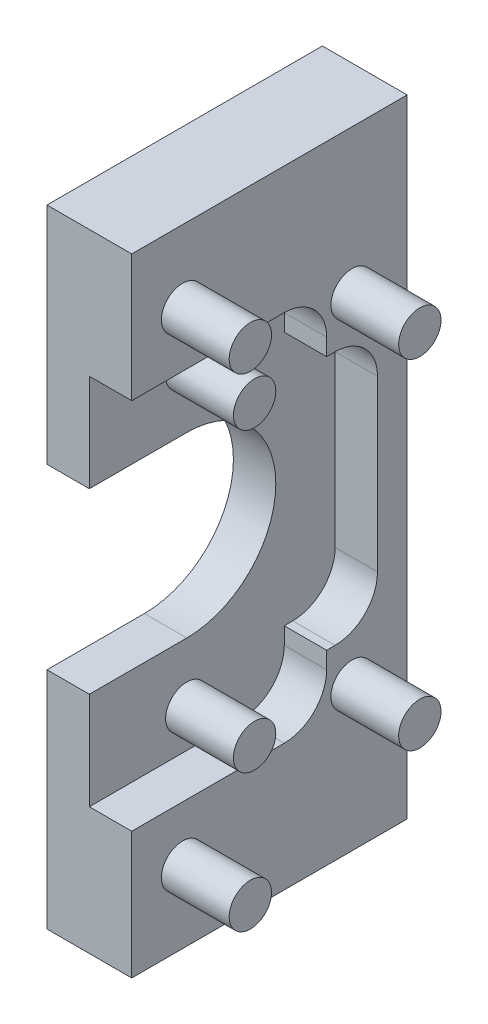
ISO-10303-21;
HEADER;
FILE_DESCRIPTION(('STEP AP214'),'2;1');
FILE_NAME('part.step','',(''),(''),'','','');
FILE_SCHEMA(('AUTOMOTIVE_DESIGN { 1 0 10303 214 1 1 1 1 }'));
ENDSEC;
DATA;
#1=APPLICATION_CONTEXT('core data for automotive mechanical design processes');
#2=APPLICATION_PROTOCOL_DEFINITION('international standard','automotive_design',2000,#1);
#3=PRODUCT_CONTEXT('',#1,'mechanical');
#4=PRODUCT('Part','Part','',(#3));
#5=PRODUCT_RELATED_PRODUCT_CATEGORY('part','',(#4));
#6=PRODUCT_DEFINITION_FORMATION('','',#4);
#7=PRODUCT_DEFINITION_CONTEXT('part definition',#1,'design');
#8=PRODUCT_DEFINITION('design','',#6,#7);
#9=PRODUCT_DEFINITION_SHAPE('','',#8);
#10=(LENGTH_UNIT() NAMED_UNIT(*) SI_UNIT(.MILLI.,.METRE.));
#11=(NAMED_UNIT(*) PLANE_ANGLE_UNIT() SI_UNIT($,.RADIAN.));
#12=(NAMED_UNIT(*) SI_UNIT($,.STERADIAN.) SOLID_ANGLE_UNIT());
#13=UNCERTAINTY_MEASURE_WITH_UNIT(LENGTH_MEASURE(1.E-05),#10,'distance_accuracy_value','');
#14=(GEOMETRIC_REPRESENTATION_CONTEXT(3) GLOBAL_UNCERTAINTY_ASSIGNED_CONTEXT((#13)) GLOBAL_UNIT_ASSIGNED_CONTEXT((#10,
#11,#12)) REPRESENTATION_CONTEXT('',''));
#15=CARTESIAN_POINT('',(0.,0.,0.));
#16=DIRECTION('',(0.,0.,1.));
#17=DIRECTION('',(1.,0.,0.));
#18=AXIS2_PLACEMENT_3D('',#15,#16,#17);
#19=CARTESIAN_POINT('',(-15.885,90.0717967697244,36.));
#20=DIRECTION('',(1.,0.,0.));
#21=DIRECTION('',(0.,-1.,0.));
#22=AXIS2_PLACEMENT_3D('',#19,#20,#21);
#23=PLANE('',#22);
#24=DIRECTION('',(0.,1.,0.));
#25=VECTOR('',#24,1.);
#26=CARTESIAN_POINT('',(-15.885,94.6905989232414,44.));
#27=LINE('',#26,#25);
#28=CARTESIAN_POINT('',(-15.885,94.6905989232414,44.));
#29=VERTEX_POINT('',#28);
#30=CARTESIAN_POINT('',(-15.885,99.3094010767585,44.));
#31=VERTEX_POINT('',#30);
#32=EDGE_CURVE('E1047',#29,#31,#27,.T.);
#33=ORIENTED_EDGE('',*,*,#32,.T.);
#34=DIRECTION('',(0.,0.5,-0.866025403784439));
#35=VECTOR('',#34,1.);
#36=CARTESIAN_POINT('',(-15.885,99.3094010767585,44.));
#37=LINE('',#36,#35);
#38=CARTESIAN_POINT('',(-15.885,101.618802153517,40.));
#39=VERTEX_POINT('',#38);
#40=EDGE_CURVE('E1142',#31,#39,#37,.T.);
#41=ORIENTED_EDGE('',*,*,#40,.T.);
#42=DIRECTION('',(0.,0.5,0.866025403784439));
#43=VECTOR('',#42,1.);
#44=CARTESIAN_POINT('',(-15.8850000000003,99.3094010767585,36.));
#45=LINE('',#44,#43);
#46=CARTESIAN_POINT('',(-15.8850000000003,99.3094010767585,36.));
#47=VERTEX_POINT('',#46);
#48=EDGE_CURVE('E1146',#47,#39,#45,.T.);
#49=ORIENTED_EDGE('',*,*,#48,.F.);
#50=DIRECTION('',(0.,1.,0.));
#51=VECTOR('',#50,1.);
#52=CARTESIAN_POINT('',(-15.885,94.6905989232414,36.));
#53=LINE('',#52,#51);
#54=CARTESIAN_POINT('',(-15.885,94.6905989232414,36.));
#55=VERTEX_POINT('',#54);
#56=EDGE_CURVE('E1154',#55,#47,#53,.T.);
#57=ORIENTED_EDGE('',*,*,#56,.F.);
#58=DIRECTION('',(0.,-0.5,0.866025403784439));
#59=VECTOR('',#58,1.);
#60=CARTESIAN_POINT('',(-15.885,94.6905989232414,36.));
#61=LINE('',#60,#59);
#62=CARTESIAN_POINT('',(-15.885,92.3811978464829,40.));
#63=VERTEX_POINT('',#62);
#64=EDGE_CURVE('E1166',#55,#63,#61,.T.);
#65=ORIENTED_EDGE('',*,*,#64,.T.);
#66=DIRECTION('',(0.,-0.5,-0.866025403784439));
#67=VECTOR('',#66,1.);
#68=CARTESIAN_POINT('',(-15.885,94.6905989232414,44.));
#69=LINE('',#68,#67);
#70=EDGE_CURVE('E1174',#29,#63,#69,.T.);
#71=ORIENTED_EDGE('',*,*,#70,.F.);
#72=EDGE_LOOP('',(#33,#41,#49,#57,#65,#71));
#73=FACE_BOUND('',#72,.T.);
#74=ADVANCED_FACE('F16',(#73),#23,.F.);
#75=CARTESIAN_POINT('',(-15.885,94.6905989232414,44.));
#76=DIRECTION('',(0.,0.866025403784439,-0.5));
#77=DIRECTION('',(0.,-0.5,-0.866025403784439));
#78=AXIS2_PLACEMENT_3D('',#75,#76,#77);
#79=PLANE('',#78);
#80=ORIENTED_EDGE('',*,*,#70,.T.);
#81=DIRECTION('',(-1.,0.,0.));
#82=VECTOR('',#81,1.);
#83=CARTESIAN_POINT('',(-15.885,92.3811978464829,40.));
#84=LINE('',#83,#82);
#85=CARTESIAN_POINT('',(-20.5,92.3811978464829,40.));
#86=VERTEX_POINT('',#85);
#87=EDGE_CURVE('E1178',#63,#86,#84,.T.);
#88=ORIENTED_EDGE('',*,*,#87,.T.);
#89=DIRECTION('',(0.,0.5,0.866025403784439));
#90=VECTOR('',#89,1.);
#91=CARTESIAN_POINT('',(-20.5,92.3811978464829,40.));
#92=LINE('',#91,#90);
#93=CARTESIAN_POINT('',(-20.5,94.6905989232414,44.));
#94=VERTEX_POINT('',#93);
#95=EDGE_CURVE('E1134',#86,#94,#92,.T.);
#96=ORIENTED_EDGE('',*,*,#95,.T.);
#97=DIRECTION('',(-1.,0.,0.));
#98=VECTOR('',#97,1.);
#99=CARTESIAN_POINT('',(-15.885,94.6905989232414,44.));
#100=LINE('',#99,#98);
#101=EDGE_CURVE('E1170',#94,#29,#100,.F.);
#102=ORIENTED_EDGE('',*,*,#101,.T.);
#103=EDGE_LOOP('',(#80,#88,#96,#102));
#104=FACE_BOUND('',#103,.T.);
#105=ADVANCED_FACE('F1201',(#104),#79,.T.);
#106=CARTESIAN_POINT('',(-15.885,94.6905989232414,44.));
#107=DIRECTION('',(0.,0.,1.));
#108=DIRECTION('',(0.,1.,0.));
#109=AXIS2_PLACEMENT_3D('',#106,#107,#108);
#110=PLANE('',#109);
#111=DIRECTION('',(-1.,0.,0.));
#112=VECTOR('',#111,1.);
#113=CARTESIAN_POINT('',(-15.885,99.3094010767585,44.));
#114=LINE('',#113,#112);
#115=CARTESIAN_POINT('',(-20.5,99.3094010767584,44.));
#116=VERTEX_POINT('',#115);
#117=EDGE_CURVE('E1138',#116,#31,#114,.F.);
#118=ORIENTED_EDGE('',*,*,#117,.T.);
#119=ORIENTED_EDGE('',*,*,#32,.F.);
#120=ORIENTED_EDGE('',*,*,#101,.F.);
#121=DIRECTION('',(0.,-1.,0.));
#122=VECTOR('',#121,1.);
#123=CARTESIAN_POINT('',(-20.5,97.,44.));
#124=LINE('',#123,#122);
#125=EDGE_CURVE('E1181',#94,#116,#124,.F.);
#126=ORIENTED_EDGE('',*,*,#125,.T.);
#127=EDGE_LOOP('',(#118,#119,#120,#126));
#128=FACE_BOUND('',#127,.T.);
#129=ADVANCED_FACE('F1209',(#128),#110,.F.);
#130=CARTESIAN_POINT('',(-15.885,99.3094010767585,44.));
#131=DIRECTION('',(0.,0.866025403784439,0.5));
#132=DIRECTION('',(0.,0.5,-0.866025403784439));
#133=AXIS2_PLACEMENT_3D('',#130,#131,#132);
#134=PLANE('',#133);
#135=DIRECTION('',(-1.,0.,0.));
#136=VECTOR('',#135,1.);
#137=CARTESIAN_POINT('',(-15.885,101.618802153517,40.));
#138=LINE('',#137,#136);
#139=CARTESIAN_POINT('',(-20.5,101.618802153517,40.));
#140=VERTEX_POINT('',#139);
#141=EDGE_CURVE('E1150',#39,#140,#138,.T.);
#142=ORIENTED_EDGE('',*,*,#141,.F.);
#143=ORIENTED_EDGE('',*,*,#40,.F.);
#144=ORIENTED_EDGE('',*,*,#117,.F.);
#145=DIRECTION('',(0.,0.5,-0.866025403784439));
#146=VECTOR('',#145,1.);
#147=CARTESIAN_POINT('',(-20.5,99.3094010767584,44.));
#148=LINE('',#147,#146);
#149=EDGE_CURVE('E1184',#116,#140,#148,.T.);
#150=ORIENTED_EDGE('',*,*,#149,.T.);
#151=EDGE_LOOP('',(#142,#143,#144,#150));
#152=FACE_BOUND('',#151,.T.);
#153=ADVANCED_FACE('F1214',(#152),#134,.F.);
#154=CARTESIAN_POINT('',(-15.8850000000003,99.3094010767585,36.));
#155=DIRECTION('',(0.,-0.866025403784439,0.5));
#156=DIRECTION('',(0.,0.5,0.866025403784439));
#157=AXIS2_PLACEMENT_3D('',#154,#155,#156);
#158=PLANE('',#157);
#159=ORIENTED_EDGE('',*,*,#48,.T.);
#160=ORIENTED_EDGE('',*,*,#141,.T.);
#161=DIRECTION('',(0.,-0.5,-0.866025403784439));
#162=VECTOR('',#161,1.);
#163=CARTESIAN_POINT('',(-20.5,101.618802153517,40.));
#164=LINE('',#163,#162);
#165=CARTESIAN_POINT('',(-20.5000000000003,99.3094010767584,36.));
#166=VERTEX_POINT('',#165);
#167=EDGE_CURVE('E1187',#140,#166,#164,.T.);
#168=ORIENTED_EDGE('',*,*,#167,.T.);
#169=DIRECTION('',(-1.,0.,0.));
#170=VECTOR('',#169,1.);
#171=CARTESIAN_POINT('',(-15.8850000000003,99.3094010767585,36.));
#172=LINE('',#171,#170);
#173=EDGE_CURVE('E1158',#47,#166,#172,.T.);
#174=ORIENTED_EDGE('',*,*,#173,.F.);
#175=EDGE_LOOP('',(#159,#160,#168,#174));
#176=FACE_BOUND('',#175,.T.);
#177=ADVANCED_FACE('F1240',(#176),#158,.T.);
#178=CARTESIAN_POINT('',(-15.885,94.6905989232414,36.));
#179=DIRECTION('',(0.,0.,1.));
#180=DIRECTION('',(0.,1.,0.));
#181=AXIS2_PLACEMENT_3D('',#178,#179,#180);
#182=PLANE('',#181);
#183=ORIENTED_EDGE('',*,*,#56,.T.);
#184=ORIENTED_EDGE('',*,*,#173,.T.);
#185=DIRECTION('',(0.,-1.,0.));
#186=VECTOR('',#185,1.);
#187=CARTESIAN_POINT('',(-20.5,97.,36.));
#188=LINE('',#187,#186);
#189=CARTESIAN_POINT('',(-20.5,94.6905989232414,36.));
#190=VERTEX_POINT('',#189);
#191=EDGE_CURVE('E1190',#166,#190,#188,.T.);
#192=ORIENTED_EDGE('',*,*,#191,.T.);
#193=DIRECTION('',(-1.,0.,0.));
#194=VECTOR('',#193,1.);
#195=CARTESIAN_POINT('',(-15.885,94.6905989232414,36.));
#196=LINE('',#195,#194);
#197=EDGE_CURVE('E1162',#190,#55,#196,.F.);
#198=ORIENTED_EDGE('',*,*,#197,.T.);
#199=EDGE_LOOP('',(#183,#184,#192,#198));
#200=FACE_BOUND('',#199,.T.);
#201=ADVANCED_FACE('F1230',(#200),#182,.T.);
#202=CARTESIAN_POINT('',(-15.885,94.6905989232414,36.));
#203=DIRECTION('',(0.,-0.866025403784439,-0.5));
#204=DIRECTION('',(0.,-0.5,0.866025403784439));
#205=AXIS2_PLACEMENT_3D('',#202,#203,#204);
#206=PLANE('',#205);
#207=ORIENTED_EDGE('',*,*,#87,.F.);
#208=ORIENTED_EDGE('',*,*,#64,.F.);
#209=ORIENTED_EDGE('',*,*,#197,.F.);
#210=DIRECTION('',(0.,-0.5,0.866025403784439));
#211=VECTOR('',#210,1.);
#212=CARTESIAN_POINT('',(-20.5,94.6905989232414,36.));
#213=LINE('',#212,#211);
#214=EDGE_CURVE('E36',#190,#86,#213,.T.);
#215=ORIENTED_EDGE('',*,*,#214,.T.);
#216=EDGE_LOOP('',(#207,#208,#209,#215));
#217=FACE_BOUND('',#216,.T.);
#218=ADVANCED_FACE('F1228',(#217),#206,.F.);
#219=CARTESIAN_POINT('',(-20.5000000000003,97.,32.4));
#220=DIRECTION('',(1.,0.,0.));
#221=DIRECTION('',(0.,-1.,0.));
#222=AXIS2_PLACEMENT_3D('',#219,#220,#221);
#223=PLANE('',#222);
#224=CARTESIAN_POINT('',(-20.5,97.,40.));
#225=DIRECTION('',(1.,0.,0.));
#226=DIRECTION('',(0.,-1.,0.));
#227=AXIS2_PLACEMENT_3D('',#224,#225,#226);
#228=CIRCLE('',#227,8.);
#229=CARTESIAN_POINT('',(-20.5,89.,40.));
#230=VERTEX_POINT('',#229);
#231=EDGE_CURVE('E1126',#230,#230,#228,.T.);
#232=ORIENTED_EDGE('',*,*,#231,.F.);
#233=EDGE_LOOP('',(#232));
#234=FACE_BOUND('',#233,.T.);
#235=ORIENTED_EDGE('',*,*,#214,.F.);
#236=ORIENTED_EDGE('',*,*,#191,.F.);
#237=ORIENTED_EDGE('',*,*,#167,.F.);
#238=ORIENTED_EDGE('',*,*,#149,.F.);
#239=ORIENTED_EDGE('',*,*,#125,.F.);
#240=ORIENTED_EDGE('',*,*,#95,.F.);
#241=EDGE_LOOP('',(#235,#236,#237,#238,#239,#240));
#242=FACE_BOUND('',#241,.T.);
#243=ADVANCED_FACE('F1205',(#234,#242),#223,.F.);
#244=CARTESIAN_POINT('',(-14.0000000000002,97.,40.));
#245=DIRECTION('',(-1.,0.,0.));
#246=DIRECTION('',(0.,1.,0.));
#247=AXIS2_PLACEMENT_3D('',#244,#245,#246);
#248=CYLINDRICAL_SURFACE('',#247,8.);
#249=CARTESIAN_POINT('',(-14.0000000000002,97.,40.));
#250=DIRECTION('',(-1.,0.,0.));
#251=DIRECTION('',(0.,1.,0.));
#252=AXIS2_PLACEMENT_3D('',#249,#250,#251);
#253=CIRCLE('',#252,8.);
#254=CARTESIAN_POINT('',(-14.0000000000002,105.,40.));
#255=VERTEX_POINT('',#254);
#256=EDGE_CURVE('E1130',#255,#255,#253,.T.);
#257=ORIENTED_EDGE('',*,*,#256,.T.);
#258=EDGE_LOOP('',(#257));
#259=FACE_BOUND('',#258,.T.);
#260=ORIENTED_EDGE('',*,*,#231,.T.);
#261=EDGE_LOOP('',(#260));
#262=FACE_BOUND('',#261,.T.);
#263=ADVANCED_FACE('F1237',(#259,#262),#248,.T.);
#264=CARTESIAN_POINT('',(-15.885,75.,37.));
#265=DIRECTION('',(1.,0.,0.));
#266=DIRECTION('',(0.,0.5,0.866025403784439));
#267=AXIS2_PLACEMENT_3D('',#264,#265,#266);
#268=PLANE('',#267);
#269=DIRECTION('',(0.,-0.5,-0.866025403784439));
#270=VECTOR('',#269,1.);
#271=CARTESIAN_POINT('',(-15.885,79.618802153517,29.));
#272=LINE('',#271,#270);
#273=CARTESIAN_POINT('',(-15.885,79.618802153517,29.));
#274=VERTEX_POINT('',#273);
#275=CARTESIAN_POINT('',(-15.885,77.3094010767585,25.));
#276=VERTEX_POINT('',#275);
#277=EDGE_CURVE('E887',#274,#276,#272,.T.);
#278=ORIENTED_EDGE('',*,*,#277,.T.);
#279=DIRECTION('',(0.,-1.,0.));
#280=VECTOR('',#279,1.);
#281=CARTESIAN_POINT('',(-15.885,77.3094010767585,25.));
#282=LINE('',#281,#280);
#283=CARTESIAN_POINT('',(-15.885,72.6905989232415,25.));
#284=VERTEX_POINT('',#283);
#285=EDGE_CURVE('E987',#276,#284,#282,.T.);
#286=ORIENTED_EDGE('',*,*,#285,.T.);
#287=DIRECTION('',(0.,0.5,-0.866025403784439));
#288=VECTOR('',#287,1.);
#289=CARTESIAN_POINT('',(-15.885,70.381197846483,29.));
#290=LINE('',#289,#288);
#291=CARTESIAN_POINT('',(-15.885,70.381197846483,29.));
#292=VERTEX_POINT('',#291);
#293=EDGE_CURVE('E990',#292,#284,#290,.T.);
#294=ORIENTED_EDGE('',*,*,#293,.F.);
#295=DIRECTION('',(0.,-0.5,-0.866025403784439));
#296=VECTOR('',#295,1.);
#297=CARTESIAN_POINT('',(-15.885,72.6905989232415,33.));
#298=LINE('',#297,#296);
#299=CARTESIAN_POINT('',(-15.885,72.6905989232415,33.));
#300=VERTEX_POINT('',#299);
#301=EDGE_CURVE('E998',#300,#292,#298,.T.);
#302=ORIENTED_EDGE('',*,*,#301,.F.);
#303=DIRECTION('',(0.,1.,0.));
#304=VECTOR('',#303,1.);
#305=CARTESIAN_POINT('',(-15.885,72.6905989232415,33.));
#306=LINE('',#305,#304);
#307=CARTESIAN_POINT('',(-15.885,77.3094010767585,33.));
#308=VERTEX_POINT('',#307);
#309=EDGE_CURVE('E1010',#300,#308,#306,.T.);
#310=ORIENTED_EDGE('',*,*,#309,.T.);
#311=DIRECTION('',(0.,-0.5,0.866025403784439));
#312=VECTOR('',#311,1.);
#313=CARTESIAN_POINT('',(-15.885,79.618802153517,29.));
#314=LINE('',#313,#312);
#315=EDGE_CURVE('E1017',#274,#308,#314,.T.);
#316=ORIENTED_EDGE('',*,*,#315,.F.);
#317=EDGE_LOOP('',(#278,#286,#294,#302,#310,#316));
#318=FACE_BOUND('',#317,.T.);
#319=ADVANCED_FACE('F1254',(#318),#268,.F.);
#320=CARTESIAN_POINT('',(-15.8850000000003,73.0717967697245,-3.99999999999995));
#321=DIRECTION('',(1.,0.,0.));
#322=DIRECTION('',(0.,-1.,0.));
#323=AXIS2_PLACEMENT_3D('',#320,#321,#322);
#324=PLANE('',#323);
#325=DIRECTION('',(0.,1.,0.));
#326=VECTOR('',#325,1.);
#327=CARTESIAN_POINT('',(-15.8850000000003,77.6905989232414,4.00000000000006));
#328=LINE('',#327,#326);
#329=CARTESIAN_POINT('',(-15.8850000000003,77.6905989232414,4.00000000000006));
#330=VERTEX_POINT('',#329);
#331=CARTESIAN_POINT('',(-15.8850000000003,82.3094010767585,4.00000000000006));
#332=VERTEX_POINT('',#331);
#333=EDGE_CURVE('E967',#330,#332,#328,.T.);
#334=ORIENTED_EDGE('',*,*,#333,.T.);
#335=DIRECTION('',(0.,0.5,-0.866025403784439));
#336=VECTOR('',#335,1.);
#337=CARTESIAN_POINT('',(-15.8850000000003,82.3094010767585,4.00000000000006));
#338=LINE('',#337,#336);
#339=CARTESIAN_POINT('',(-15.8850000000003,84.6188021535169,0.));
#340=VERTEX_POINT('',#339);
#341=EDGE_CURVE('E1067',#332,#340,#338,.T.);
#342=ORIENTED_EDGE('',*,*,#341,.T.);
#343=DIRECTION('',(0.,0.5,0.866025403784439));
#344=VECTOR('',#343,1.);
#345=CARTESIAN_POINT('',(-15.8850000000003,82.3094010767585,-3.99999999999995));
#346=LINE('',#345,#344);
#347=CARTESIAN_POINT('',(-15.8850000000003,82.3094010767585,-3.99999999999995));
#348=VERTEX_POINT('',#347);
#349=EDGE_CURVE('E1070',#348,#340,#346,.T.);
#350=ORIENTED_EDGE('',*,*,#349,.F.);
#351=DIRECTION('',(0.,1.,0.));
#352=VECTOR('',#351,1.);
#353=CARTESIAN_POINT('',(-15.8850000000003,77.6905989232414,-3.99999999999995));
#354=LINE('',#353,#352);
#355=CARTESIAN_POINT('',(-15.8850000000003,77.6905989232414,-3.99999999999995));
#356=VERTEX_POINT('',#355);
#357=EDGE_CURVE('E1078',#356,#348,#354,.T.);
#358=ORIENTED_EDGE('',*,*,#357,.F.);
#359=DIRECTION('',(0.,-0.5,0.866025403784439));
#360=VECTOR('',#359,1.);
#361=CARTESIAN_POINT('',(-15.8850000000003,77.6905989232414,-3.99999999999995));
#362=LINE('',#361,#360);
#363=CARTESIAN_POINT('',(-15.8850000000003,75.381197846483,0.));
#364=VERTEX_POINT('',#363);
#365=EDGE_CURVE('E1090',#356,#364,#362,.T.);
#366=ORIENTED_EDGE('',*,*,#365,.T.);
#367=DIRECTION('',(0.,-0.5,-0.866025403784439));
#368=VECTOR('',#367,1.);
#369=CARTESIAN_POINT('',(-15.8850000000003,77.6905989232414,4.00000000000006));
#370=LINE('',#369,#368);
#371=EDGE_CURVE('E1097',#330,#364,#370,.T.);
#372=ORIENTED_EDGE('',*,*,#371,.F.);
#373=EDGE_LOOP('',(#334,#342,#350,#358,#366,#372));
#374=FACE_BOUND('',#373,.T.);
#375=ADVANCED_FACE('F1290',(#374),#324,.F.);
#376=CARTESIAN_POINT('',(-15.885,-6.92820323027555,-3.99999999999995));
#377=DIRECTION('',(1.,0.,0.));
#378=DIRECTION('',(0.,-1.,0.));
#379=AXIS2_PLACEMENT_3D('',#376,#377,#378);
#380=PLANE('',#379);
#381=DIRECTION('',(0.,1.,0.));
#382=VECTOR('',#381,1.);
#383=CARTESIAN_POINT('',(-15.885,-2.30940107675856,4.00000000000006));
#384=LINE('',#383,#382);
#385=CARTESIAN_POINT('',(-15.885,-2.30940107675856,4.00000000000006));
#386=VERTEX_POINT('',#385);
#387=CARTESIAN_POINT('',(-15.885,2.30940107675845,4.00000000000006));
#388=VERTEX_POINT('',#387);
#389=EDGE_CURVE('E730',#386,#388,#384,.T.);
#390=ORIENTED_EDGE('',*,*,#389,.T.);
#391=DIRECTION('',(0.,0.5,-0.866025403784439));
#392=VECTOR('',#391,1.);
#393=CARTESIAN_POINT('',(-15.885,2.30940107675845,4.00000000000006));
#394=LINE('',#393,#392);
#395=CARTESIAN_POINT('',(-15.885,4.61880215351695,0.));
#396=VERTEX_POINT('',#395);
#397=EDGE_CURVE('E827',#388,#396,#394,.T.);
#398=ORIENTED_EDGE('',*,*,#397,.T.);
#399=DIRECTION('',(0.,0.5,0.866025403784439));
#400=VECTOR('',#399,1.);
#401=CARTESIAN_POINT('',(-15.885,2.30940107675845,-3.99999999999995));
#402=LINE('',#401,#400);
#403=CARTESIAN_POINT('',(-15.885,2.30940107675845,-3.99999999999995));
#404=VERTEX_POINT('',#403);
#405=EDGE_CURVE('E830',#404,#396,#402,.T.);
#406=ORIENTED_EDGE('',*,*,#405,.F.);
#407=DIRECTION('',(0.,1.,0.));
#408=VECTOR('',#407,1.);
#409=CARTESIAN_POINT('',(-15.885,-2.30940107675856,-3.99999999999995));
#410=LINE('',#409,#408);
#411=CARTESIAN_POINT('',(-15.885,-2.30940107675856,-3.99999999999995));
#412=VERTEX_POINT('',#411);
#413=EDGE_CURVE('E838',#412,#404,#410,.T.);
#414=ORIENTED_EDGE('',*,*,#413,.F.);
#415=DIRECTION('',(0.,-0.5,0.866025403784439));
#416=VECTOR('',#415,1.);
#417=CARTESIAN_POINT('',(-15.885,-2.30940107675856,-3.99999999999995));
#418=LINE('',#417,#416);
#419=CARTESIAN_POINT('',(-15.885,-4.61880215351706,0.));
#420=VERTEX_POINT('',#419);
#421=EDGE_CURVE('E850',#412,#420,#418,.T.);
#422=ORIENTED_EDGE('',*,*,#421,.T.);
#423=DIRECTION('',(0.,-0.5,-0.866025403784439));
#424=VECTOR('',#423,1.);
#425=CARTESIAN_POINT('',(-15.885,-2.30940107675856,4.00000000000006));
#426=LINE('',#425,#424);
#427=EDGE_CURVE('E857',#386,#420,#426,.T.);
#428=ORIENTED_EDGE('',*,*,#427,.F.);
#429=EDGE_LOOP('',(#390,#398,#406,#414,#422,#428));
#430=FACE_BOUND('',#429,.T.);
#431=ADVANCED_FACE('F1293',(#430),#380,.F.);
#432=CARTESIAN_POINT('',(-15.885,4.99999999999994,37.));
#433=DIRECTION('',(1.,0.,0.));
#434=DIRECTION('',(0.,0.5,0.866025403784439));
#435=AXIS2_PLACEMENT_3D('',#432,#433,#434);
#436=PLANE('',#435);
#437=DIRECTION('',(0.,-0.5,-0.866025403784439));
#438=VECTOR('',#437,1.);
#439=CARTESIAN_POINT('',(-15.885,9.61880215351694,29.));
#440=LINE('',#439,#438);
#441=CARTESIAN_POINT('',(-15.885,9.61880215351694,29.));
#442=VERTEX_POINT('',#441);
#443=CARTESIAN_POINT('',(-15.885,7.30940107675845,25.));
#444=VERTEX_POINT('',#443);
#445=EDGE_CURVE('E807',#442,#444,#440,.T.);
#446=ORIENTED_EDGE('',*,*,#445,.T.);
#447=DIRECTION('',(0.,-1.,0.));
#448=VECTOR('',#447,1.);
#449=CARTESIAN_POINT('',(-15.885,7.30940107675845,25.));
#450=LINE('',#449,#448);
#451=CARTESIAN_POINT('',(-15.885,2.69059892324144,25.));
#452=VERTEX_POINT('',#451);
#453=EDGE_CURVE('E907',#444,#452,#450,.T.);
#454=ORIENTED_EDGE('',*,*,#453,.T.);
#455=DIRECTION('',(0.,0.5,-0.866025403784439));
#456=VECTOR('',#455,1.);
#457=CARTESIAN_POINT('',(-15.885,0.381197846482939,29.));
#458=LINE('',#457,#456);
#459=CARTESIAN_POINT('',(-15.885,0.381197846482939,29.));
#460=VERTEX_POINT('',#459);
#461=EDGE_CURVE('E910',#460,#452,#458,.T.);
#462=ORIENTED_EDGE('',*,*,#461,.F.);
#463=DIRECTION('',(0.,-0.5,-0.866025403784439));
#464=VECTOR('',#463,1.);
#465=CARTESIAN_POINT('',(-15.885,2.69059892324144,33.));
#466=LINE('',#465,#464);
#467=CARTESIAN_POINT('',(-15.885,2.69059892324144,33.));
#468=VERTEX_POINT('',#467);
#469=EDGE_CURVE('E918',#468,#460,#466,.T.);
#470=ORIENTED_EDGE('',*,*,#469,.F.);
#471=DIRECTION('',(0.,1.,0.));
#472=VECTOR('',#471,1.);
#473=CARTESIAN_POINT('',(-15.885,2.69059892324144,33.));
#474=LINE('',#473,#472);
#475=CARTESIAN_POINT('',(-15.885,7.30940107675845,33.));
#476=VERTEX_POINT('',#475);
#477=EDGE_CURVE('E930',#468,#476,#474,.T.);
#478=ORIENTED_EDGE('',*,*,#477,.T.);
#479=DIRECTION('',(0.,-0.5,0.866025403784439));
#480=VECTOR('',#479,1.);
#481=CARTESIAN_POINT('',(-15.885,9.61880215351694,29.));
#482=LINE('',#481,#480);
#483=EDGE_CURVE('E937',#442,#476,#482,.T.);
#484=ORIENTED_EDGE('',*,*,#483,.F.);
#485=EDGE_LOOP('',(#446,#454,#462,#470,#478,#484));
#486=FACE_BOUND('',#485,.T.);
#487=ADVANCED_FACE('F1391',(#486),#436,.F.);
#488=CARTESIAN_POINT('',(-15.885,-23.9282032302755,36.));
#489=DIRECTION('',(1.,0.,0.));
#490=DIRECTION('',(0.,-1.,0.));
#491=AXIS2_PLACEMENT_3D('',#488,#489,#490);
#492=PLANE('',#491);
#493=DIRECTION('',(0.,1.,0.));
#494=VECTOR('',#493,1.);
#495=CARTESIAN_POINT('',(-15.885,-19.3094010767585,44.));
#496=LINE('',#495,#494);
#497=CARTESIAN_POINT('',(-15.885,-19.3094010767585,44.));
#498=VERTEX_POINT('',#497);
#499=CARTESIAN_POINT('',(-15.885,-14.6905989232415,44.));
#500=VERTEX_POINT('',#499);
#501=EDGE_CURVE('E386',#498,#500,#496,.T.);
#502=ORIENTED_EDGE('',*,*,#501,.T.);
#503=DIRECTION('',(0.,0.5,-0.866025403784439));
#504=VECTOR('',#503,1.);
#505=CARTESIAN_POINT('',(-15.885,-14.6905989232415,44.));
#506=LINE('',#505,#504);
#507=CARTESIAN_POINT('',(-15.885,-12.3811978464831,40.));
#508=VERTEX_POINT('',#507);
#509=EDGE_CURVE('E747',#500,#508,#506,.T.);
#510=ORIENTED_EDGE('',*,*,#509,.T.);
#511=DIRECTION('',(0.,0.5,0.866025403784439));
#512=VECTOR('',#511,1.);
#513=CARTESIAN_POINT('',(-15.885,-14.6905989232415,36.));
#514=LINE('',#513,#512);
#515=CARTESIAN_POINT('',(-15.885,-14.6905989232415,36.));
#516=VERTEX_POINT('',#515);
#517=EDGE_CURVE('E750',#516,#508,#514,.T.);
#518=ORIENTED_EDGE('',*,*,#517,.F.);
#519=DIRECTION('',(0.,1.,0.));
#520=VECTOR('',#519,1.);
#521=CARTESIAN_POINT('',(-15.885,-19.3094010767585,36.));
#522=LINE('',#521,#520);
#523=CARTESIAN_POINT('',(-15.885,-19.3094010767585,36.));
#524=VERTEX_POINT('',#523);
#525=EDGE_CURVE('E758',#524,#516,#522,.T.);
#526=ORIENTED_EDGE('',*,*,#525,.F.);
#527=DIRECTION('',(0.,-0.5,0.866025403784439));
#528=VECTOR('',#527,1.);
#529=CARTESIAN_POINT('',(-15.885,-19.3094010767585,36.));
#530=LINE('',#529,#528);
#531=CARTESIAN_POINT('',(-15.885,-21.618802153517,40.));
#532=VERTEX_POINT('',#531);
#533=EDGE_CURVE('E770',#524,#532,#530,.T.);
#534=ORIENTED_EDGE('',*,*,#533,.T.);
#535=DIRECTION('',(0.,-0.5,-0.866025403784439));
#536=VECTOR('',#535,1.);
#537=CARTESIAN_POINT('',(-15.885,-19.3094010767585,44.));
#538=LINE('',#537,#536);
#539=EDGE_CURVE('E777',#498,#532,#538,.T.);
#540=ORIENTED_EDGE('',*,*,#539,.F.);
#541=EDGE_LOOP('',(#502,#510,#518,#526,#534,#540));
#542=FACE_BOUND('',#541,.T.);
#543=ADVANCED_FACE('F1322',(#542),#492,.F.);
#544=CARTESIAN_POINT('',(-15.885,79.618802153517,29.));
#545=DIRECTION('',(0.,-0.866025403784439,-0.5));
#546=DIRECTION('',(0.,-0.5,0.866025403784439));
#547=AXIS2_PLACEMENT_3D('',#544,#545,#546);
#548=PLANE('',#547);
#549=ORIENTED_EDGE('',*,*,#315,.T.);
#550=DIRECTION('',(-1.,0.,0.));
#551=VECTOR('',#550,1.);
#552=CARTESIAN_POINT('',(-15.885,77.3094010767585,33.));
#553=LINE('',#552,#551);
#554=CARTESIAN_POINT('',(-20.5,77.3094010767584,33.));
#555=VERTEX_POINT('',#554);
#556=EDGE_CURVE('E1021',#308,#555,#553,.T.);
#557=ORIENTED_EDGE('',*,*,#556,.T.);
#558=DIRECTION('',(0.,0.5,-0.866025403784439));
#559=VECTOR('',#558,1.);
#560=CARTESIAN_POINT('',(-20.5,77.3094010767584,33.));
#561=LINE('',#560,#559);
#562=CARTESIAN_POINT('',(-20.5,79.6188021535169,29.));
#563=VERTEX_POINT('',#562);
#564=EDGE_CURVE('E980',#555,#563,#561,.T.);
#565=ORIENTED_EDGE('',*,*,#564,.T.);
#566=DIRECTION('',(-1.,0.,0.));
#567=VECTOR('',#566,1.);
#568=CARTESIAN_POINT('',(-15.885,79.618802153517,29.));
#569=LINE('',#568,#567);
#570=EDGE_CURVE('E1013',#563,#274,#569,.F.);
#571=ORIENTED_EDGE('',*,*,#570,.T.);
#572=EDGE_LOOP('',(#549,#557,#565,#571));
#573=FACE_BOUND('',#572,.T.);
#574=ADVANCED_FACE('F1318',(#573),#548,.T.);
#575=CARTESIAN_POINT('',(-15.885,79.618802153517,29.));
#576=DIRECTION('',(0.,0.866025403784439,-0.5));
#577=DIRECTION('',(0.,-0.5,-0.866025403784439));
#578=AXIS2_PLACEMENT_3D('',#575,#576,#577);
#579=PLANE('',#578);
#580=DIRECTION('',(-1.,0.,0.));
#581=VECTOR('',#580,1.);
#582=CARTESIAN_POINT('',(-15.885,77.3094010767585,25.));
#583=LINE('',#582,#581);
#584=CARTESIAN_POINT('',(-20.5,77.3094010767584,25.));
#585=VERTEX_POINT('',#584);
#586=EDGE_CURVE('E983',#585,#276,#583,.F.);
#587=ORIENTED_EDGE('',*,*,#586,.T.);
#588=ORIENTED_EDGE('',*,*,#277,.F.);
#589=ORIENTED_EDGE('',*,*,#570,.F.);
#590=DIRECTION('',(0.,0.5,0.866025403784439));
#591=VECTOR('',#590,1.);
#592=CARTESIAN_POINT('',(-20.5,78.4641016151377,27.));
#593=LINE('',#592,#591);
#594=EDGE_CURVE('E1025',#563,#585,#593,.F.);
#595=ORIENTED_EDGE('',*,*,#594,.T.);
#596=EDGE_LOOP('',(#587,#588,#589,#595));
#597=FACE_BOUND('',#596,.T.);
#598=ADVANCED_FACE('F1321',(#597),#579,.F.);
#599=CARTESIAN_POINT('',(-15.885,77.3094010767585,25.));
#600=DIRECTION('',(0.,0.,-1.));
#601=DIRECTION('',(0.,-1.,0.));
#602=AXIS2_PLACEMENT_3D('',#599,#600,#601);
#603=PLANE('',#602);
#604=DIRECTION('',(-1.,0.,0.));
#605=VECTOR('',#604,1.);
#606=CARTESIAN_POINT('',(-15.885,72.6905989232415,25.));
#607=LINE('',#606,#605);
#608=CARTESIAN_POINT('',(-20.5,72.6905989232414,25.));
#609=VERTEX_POINT('',#608);
#610=EDGE_CURVE('E994',#284,#609,#607,.T.);
#611=ORIENTED_EDGE('',*,*,#610,.F.);
#612=ORIENTED_EDGE('',*,*,#285,.F.);
#613=ORIENTED_EDGE('',*,*,#586,.F.);
#614=DIRECTION('',(0.,-1.,0.));
#615=VECTOR('',#614,1.);
#616=CARTESIAN_POINT('',(-20.5,77.3094010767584,25.));
#617=LINE('',#616,#615);
#618=EDGE_CURVE('E1028',#585,#609,#617,.T.);
#619=ORIENTED_EDGE('',*,*,#618,.T.);
#620=EDGE_LOOP('',(#611,#612,#613,#619));
#621=FACE_BOUND('',#620,.T.);
#622=ADVANCED_FACE('F1334',(#621),#603,.F.);
#623=CARTESIAN_POINT('',(-15.885,70.381197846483,29.));
#624=DIRECTION('',(0.,0.866025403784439,0.5));
#625=DIRECTION('',(0.,0.5,-0.866025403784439));
#626=AXIS2_PLACEMENT_3D('',#623,#624,#625);
#627=PLANE('',#626);
#628=ORIENTED_EDGE('',*,*,#293,.T.);
#629=ORIENTED_EDGE('',*,*,#610,.T.);
#630=DIRECTION('',(0.,-0.5,0.866025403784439));
#631=VECTOR('',#630,1.);
#632=CARTESIAN_POINT('',(-20.5,72.6905989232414,25.));
#633=LINE('',#632,#631);
#634=CARTESIAN_POINT('',(-20.5,70.3811978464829,29.));
#635=VERTEX_POINT('',#634);
#636=EDGE_CURVE('E1031',#609,#635,#633,.T.);
#637=ORIENTED_EDGE('',*,*,#636,.T.);
#638=DIRECTION('',(-1.,0.,0.));
#639=VECTOR('',#638,1.);
#640=CARTESIAN_POINT('',(-15.885,70.381197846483,29.));
#641=LINE('',#640,#639);
#642=EDGE_CURVE('E1002',#292,#635,#641,.T.);
#643=ORIENTED_EDGE('',*,*,#642,.F.);
#644=EDGE_LOOP('',(#628,#629,#637,#643));
#645=FACE_BOUND('',#644,.T.);
#646=ADVANCED_FACE('F1330',(#645),#627,.T.);
#647=CARTESIAN_POINT('',(-15.885,72.6905989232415,33.));
#648=DIRECTION('',(0.,0.866025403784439,-0.5));
#649=DIRECTION('',(0.,-0.5,-0.866025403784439));
#650=AXIS2_PLACEMENT_3D('',#647,#648,#649);
#651=PLANE('',#650);
#652=ORIENTED_EDGE('',*,*,#301,.T.);
#653=ORIENTED_EDGE('',*,*,#642,.T.);
#654=DIRECTION('',(0.,0.5,0.866025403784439));
#655=VECTOR('',#654,1.);
#656=CARTESIAN_POINT('',(-20.5,71.5358983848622,31.));
#657=LINE('',#656,#655);
#658=CARTESIAN_POINT('',(-20.5,72.6905989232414,33.));
#659=VERTEX_POINT('',#658);
#660=EDGE_CURVE('E1034',#635,#659,#657,.T.);
#661=ORIENTED_EDGE('',*,*,#660,.T.);
#662=DIRECTION('',(-1.,0.,0.));
#663=VECTOR('',#662,1.);
#664=CARTESIAN_POINT('',(-15.885,72.6905989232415,33.));
#665=LINE('',#664,#663);
#666=EDGE_CURVE('E1006',#659,#300,#665,.F.);
#667=ORIENTED_EDGE('',*,*,#666,.T.);
#668=EDGE_LOOP('',(#652,#653,#661,#667));
#669=FACE_BOUND('',#668,.T.);
#670=ADVANCED_FACE('F1326',(#669),#651,.T.);
#671=CARTESIAN_POINT('',(-15.885,72.6905989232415,33.));
#672=DIRECTION('',(0.,0.,1.));
#673=DIRECTION('',(0.,1.,0.));
#674=AXIS2_PLACEMENT_3D('',#671,#672,#673);
#675=PLANE('',#674);
#676=ORIENTED_EDGE('',*,*,#556,.F.);
#677=ORIENTED_EDGE('',*,*,#309,.F.);
#678=ORIENTED_EDGE('',*,*,#666,.F.);
#679=DIRECTION('',(0.,1.,0.));
#680=VECTOR('',#679,1.);
#681=CARTESIAN_POINT('',(-20.5,72.6905989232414,33.));
#682=LINE('',#681,#680);
#683=EDGE_CURVE('E1037',#659,#555,#682,.T.);
#684=ORIENTED_EDGE('',*,*,#683,.T.);
#685=EDGE_LOOP('',(#676,#677,#678,#684));
#686=FACE_BOUND('',#685,.T.);
#687=ADVANCED_FACE('F1268',(#686),#675,.F.);
#688=CARTESIAN_POINT('',(-15.8850000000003,77.6905989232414,4.00000000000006));
#689=DIRECTION('',(0.,0.866025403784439,-0.5));
#690=DIRECTION('',(0.,-0.5,-0.866025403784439));
#691=AXIS2_PLACEMENT_3D('',#688,#689,#690);
#692=PLANE('',#691);
#693=ORIENTED_EDGE('',*,*,#371,.T.);
#694=DIRECTION('',(-1.,0.,0.));
#695=VECTOR('',#694,1.);
#696=CARTESIAN_POINT('',(-15.8850000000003,75.381197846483,0.));
#697=LINE('',#696,#695);
#698=CARTESIAN_POINT('',(-20.5000000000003,75.3811978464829,0.));
#699=VERTEX_POINT('',#698);
#700=EDGE_CURVE('E1101',#364,#699,#697,.T.);
#701=ORIENTED_EDGE('',*,*,#700,.T.);
#702=DIRECTION('',(0.,0.5,0.866025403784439));
#703=VECTOR('',#702,1.);
#704=CARTESIAN_POINT('',(-20.5000000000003,75.3811978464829,0.));
#705=LINE('',#704,#703);
#706=CARTESIAN_POINT('',(-20.5000000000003,77.6905989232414,4.00000000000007));
#707=VERTEX_POINT('',#706);
#708=EDGE_CURVE('E1060',#699,#707,#705,.T.);
#709=ORIENTED_EDGE('',*,*,#708,.T.);
#710=DIRECTION('',(-1.,0.,0.));
#711=VECTOR('',#710,1.);
#712=CARTESIAN_POINT('',(-15.8850000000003,77.6905989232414,4.00000000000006));
#713=LINE('',#712,#711);
#714=EDGE_CURVE('E1093',#707,#330,#713,.F.);
#715=ORIENTED_EDGE('',*,*,#714,.T.);
#716=EDGE_LOOP('',(#693,#701,#709,#715));
#717=FACE_BOUND('',#716,.T.);
#718=ADVANCED_FACE('F1264',(#717),#692,.T.);
#719=CARTESIAN_POINT('',(-15.8850000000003,77.6905989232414,4.00000000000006));
#720=DIRECTION('',(0.,0.,1.));
#721=DIRECTION('',(0.,1.,0.));
#722=AXIS2_PLACEMENT_3D('',#719,#720,#721);
#723=PLANE('',#722);
#724=DIRECTION('',(-1.,0.,0.));
#725=VECTOR('',#724,1.);
#726=CARTESIAN_POINT('',(-15.8850000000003,82.3094010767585,4.00000000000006));
#727=LINE('',#726,#725);
#728=CARTESIAN_POINT('',(-20.5000000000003,82.3094010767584,4.00000000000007));
#729=VERTEX_POINT('',#728);
#730=EDGE_CURVE('E1063',#729,#332,#727,.F.);
#731=ORIENTED_EDGE('',*,*,#730,.T.);
#732=ORIENTED_EDGE('',*,*,#333,.F.);
#733=ORIENTED_EDGE('',*,*,#714,.F.);
#734=DIRECTION('',(0.,-1.,0.));
#735=VECTOR('',#734,1.);
#736=CARTESIAN_POINT('',(-20.5000000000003,80.,4.00000000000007));
#737=LINE('',#736,#735);
#738=EDGE_CURVE('E1105',#707,#729,#737,.F.);
#739=ORIENTED_EDGE('',*,*,#738,.T.);
#740=EDGE_LOOP('',(#731,#732,#733,#739));
#741=FACE_BOUND('',#740,.T.);
#742=ADVANCED_FACE('F1267',(#741),#723,.F.);
#743=CARTESIAN_POINT('',(-15.8850000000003,82.3094010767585,4.00000000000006));
#744=DIRECTION('',(0.,0.866025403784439,0.5));
#745=DIRECTION('',(0.,0.5,-0.866025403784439));
#746=AXIS2_PLACEMENT_3D('',#743,#744,#745);
#747=PLANE('',#746);
#748=DIRECTION('',(-1.,0.,0.));
#749=VECTOR('',#748,1.);
#750=CARTESIAN_POINT('',(-15.8850000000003,84.6188021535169,0.));
#751=LINE('',#750,#749);
#752=CARTESIAN_POINT('',(-20.5000000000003,84.6188021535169,0.));
#753=VERTEX_POINT('',#752);
#754=EDGE_CURVE('E1074',#340,#753,#751,.T.);
#755=ORIENTED_EDGE('',*,*,#754,.F.);
#756=ORIENTED_EDGE('',*,*,#341,.F.);
#757=ORIENTED_EDGE('',*,*,#730,.F.);
#758=DIRECTION('',(0.,0.5,-0.866025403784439));
#759=VECTOR('',#758,1.);
#760=CARTESIAN_POINT('',(-20.5000000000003,82.3094010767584,4.00000000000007));
#761=LINE('',#760,#759);
#762=EDGE_CURVE('E1108',#729,#753,#761,.T.);
#763=ORIENTED_EDGE('',*,*,#762,.T.);
#764=EDGE_LOOP('',(#755,#756,#757,#763));
#765=FACE_BOUND('',#764,.T.);
#766=ADVANCED_FACE('F1282',(#765),#747,.F.);
#767=CARTESIAN_POINT('',(-15.8850000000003,82.3094010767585,-3.99999999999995));
#768=DIRECTION('',(0.,-0.866025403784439,0.5));
#769=DIRECTION('',(0.,0.5,0.866025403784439));
#770=AXIS2_PLACEMENT_3D('',#767,#768,#769);
#771=PLANE('',#770);
#772=ORIENTED_EDGE('',*,*,#349,.T.);
#773=ORIENTED_EDGE('',*,*,#754,.T.);
#774=DIRECTION('',(0.,-0.5,-0.866025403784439));
#775=VECTOR('',#774,1.);
#776=CARTESIAN_POINT('',(-20.5000000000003,84.6188021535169,0.));
#777=LINE('',#776,#775);
#778=CARTESIAN_POINT('',(-20.5000000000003,82.3094010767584,-3.99999999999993));
#779=VERTEX_POINT('',#778);
#780=EDGE_CURVE('E1111',#753,#779,#777,.T.);
#781=ORIENTED_EDGE('',*,*,#780,.T.);
#782=DIRECTION('',(-1.,0.,0.));
#783=VECTOR('',#782,1.);
#784=CARTESIAN_POINT('',(-15.8850000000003,82.3094010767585,-3.99999999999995));
#785=LINE('',#784,#783);
#786=EDGE_CURVE('E1082',#348,#779,#785,.T.);
#787=ORIENTED_EDGE('',*,*,#786,.F.);
#788=EDGE_LOOP('',(#772,#773,#781,#787));
#789=FACE_BOUND('',#788,.T.);
#790=ADVANCED_FACE('F1278',(#789),#771,.T.);
#791=CARTESIAN_POINT('',(-15.8850000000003,77.6905989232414,-3.99999999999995));
#792=DIRECTION('',(0.,0.,1.));
#793=DIRECTION('',(0.,1.,0.));
#794=AXIS2_PLACEMENT_3D('',#791,#792,#793);
#795=PLANE('',#794);
#796=ORIENTED_EDGE('',*,*,#357,.T.);
#797=ORIENTED_EDGE('',*,*,#786,.T.);
#798=DIRECTION('',(0.,-1.,0.));
#799=VECTOR('',#798,1.);
#800=CARTESIAN_POINT('',(-20.5000000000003,80.,-3.99999999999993));
#801=LINE('',#800,#799);
#802=CARTESIAN_POINT('',(-20.5000000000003,77.6905989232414,-3.99999999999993));
#803=VERTEX_POINT('',#802);
#804=EDGE_CURVE('E1114',#779,#803,#801,.T.);
#805=ORIENTED_EDGE('',*,*,#804,.T.);
#806=DIRECTION('',(-1.,0.,0.));
#807=VECTOR('',#806,1.);
#808=CARTESIAN_POINT('',(-15.8850000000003,77.6905989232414,-3.99999999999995));
#809=LINE('',#808,#807);
#810=EDGE_CURVE('E1086',#803,#356,#809,.F.);
#811=ORIENTED_EDGE('',*,*,#810,.T.);
#812=EDGE_LOOP('',(#796,#797,#805,#811));
#813=FACE_BOUND('',#812,.T.);
#814=ADVANCED_FACE('F1274',(#813),#795,.T.);
#815=CARTESIAN_POINT('',(-15.8850000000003,77.6905989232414,-3.99999999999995));
#816=DIRECTION('',(0.,-0.866025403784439,-0.5));
#817=DIRECTION('',(0.,-0.5,0.866025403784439));
#818=AXIS2_PLACEMENT_3D('',#815,#816,#817);
#819=PLANE('',#818);
#820=ORIENTED_EDGE('',*,*,#700,.F.);
#821=ORIENTED_EDGE('',*,*,#365,.F.);
#822=ORIENTED_EDGE('',*,*,#810,.F.);
#823=DIRECTION('',(0.,-0.5,0.866025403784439));
#824=VECTOR('',#823,1.);
#825=CARTESIAN_POINT('',(-20.5000000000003,77.6905989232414,-3.99999999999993));
#826=LINE('',#825,#824);
#827=EDGE_CURVE('E1117',#803,#699,#826,.T.);
#828=ORIENTED_EDGE('',*,*,#827,.T.);
#829=EDGE_LOOP('',(#820,#821,#822,#828));
#830=FACE_BOUND('',#829,.T.);
#831=ADVANCED_FACE('F1270',(#830),#819,.F.);
#832=CARTESIAN_POINT('',(-15.885,-2.30940107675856,4.00000000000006));
#833=DIRECTION('',(0.,0.866025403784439,-0.5));
#834=DIRECTION('',(0.,-0.5,-0.866025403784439));
#835=AXIS2_PLACEMENT_3D('',#832,#833,#834);
#836=PLANE('',#835);
#837=ORIENTED_EDGE('',*,*,#427,.T.);
#838=DIRECTION('',(-1.,0.,0.));
#839=VECTOR('',#838,1.);
#840=CARTESIAN_POINT('',(-15.885,-4.61880215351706,0.));
#841=LINE('',#840,#839);
#842=CARTESIAN_POINT('',(-20.5,-4.61880215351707,0.));
#843=VERTEX_POINT('',#842);
#844=EDGE_CURVE('E861',#420,#843,#841,.T.);
#845=ORIENTED_EDGE('',*,*,#844,.T.);
#846=DIRECTION('',(0.,0.5,0.866025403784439));
#847=VECTOR('',#846,1.);
#848=CARTESIAN_POINT('',(-20.5,-4.61880215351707,0.));
#849=LINE('',#848,#847);
#850=CARTESIAN_POINT('',(-20.5,-2.30940107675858,4.00000000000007));
#851=VERTEX_POINT('',#850);
#852=EDGE_CURVE('E820',#843,#851,#849,.T.);
#853=ORIENTED_EDGE('',*,*,#852,.T.);
#854=DIRECTION('',(-1.,0.,0.));
#855=VECTOR('',#854,1.);
#856=CARTESIAN_POINT('',(-15.885,-2.30940107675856,4.00000000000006));
#857=LINE('',#856,#855);
#858=EDGE_CURVE('E853',#851,#386,#857,.F.);
#859=ORIENTED_EDGE('',*,*,#858,.T.);
#860=EDGE_LOOP('',(#837,#845,#853,#859));
#861=FACE_BOUND('',#860,.T.);
#862=ADVANCED_FACE('F1273',(#861),#836,.T.);
#863=CARTESIAN_POINT('',(-15.885,-2.30940107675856,4.00000000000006));
#864=DIRECTION('',(0.,0.,1.));
#865=DIRECTION('',(0.,1.,0.));
#866=AXIS2_PLACEMENT_3D('',#863,#864,#865);
#867=PLANE('',#866);
#868=DIRECTION('',(-1.,0.,0.));
#869=VECTOR('',#868,1.);
#870=CARTESIAN_POINT('',(-15.885,2.30940107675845,4.00000000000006));
#871=LINE('',#870,#869);
#872=CARTESIAN_POINT('',(-20.5,2.30940107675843,4.00000000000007));
#873=VERTEX_POINT('',#872);
#874=EDGE_CURVE('E823',#873,#388,#871,.F.);
#875=ORIENTED_EDGE('',*,*,#874,.T.);
#876=ORIENTED_EDGE('',*,*,#389,.F.);
#877=ORIENTED_EDGE('',*,*,#858,.F.);
#878=DIRECTION('',(0.,-1.,0.));
#879=VECTOR('',#878,1.);
#880=CARTESIAN_POINT('',(-20.5,0.,4.00000000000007));
#881=LINE('',#880,#879);
#882=EDGE_CURVE('E865',#851,#873,#881,.F.);
#883=ORIENTED_EDGE('',*,*,#882,.T.);
#884=EDGE_LOOP('',(#875,#876,#877,#883));
#885=FACE_BOUND('',#884,.T.);
#886=ADVANCED_FACE('F1413',(#885),#867,.F.);
#887=CARTESIAN_POINT('',(-15.885,2.30940107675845,4.00000000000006));
#888=DIRECTION('',(0.,0.866025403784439,0.5));
#889=DIRECTION('',(0.,0.5,-0.866025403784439));
#890=AXIS2_PLACEMENT_3D('',#887,#888,#889);
#891=PLANE('',#890);
#892=DIRECTION('',(-1.,0.,0.));
#893=VECTOR('',#892,1.);
#894=CARTESIAN_POINT('',(-15.885,4.61880215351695,0.));
#895=LINE('',#894,#893);
#896=CARTESIAN_POINT('',(-20.5,4.61880215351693,0.));
#897=VERTEX_POINT('',#896);
#898=EDGE_CURVE('E834',#396,#897,#895,.T.);
#899=ORIENTED_EDGE('',*,*,#898,.F.);
#900=ORIENTED_EDGE('',*,*,#397,.F.);
#901=ORIENTED_EDGE('',*,*,#874,.F.);
#902=DIRECTION('',(0.,0.5,-0.866025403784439));
#903=VECTOR('',#902,1.);
#904=CARTESIAN_POINT('',(-20.5,2.30940107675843,4.00000000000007));
#905=LINE('',#904,#903);
#906=EDGE_CURVE('E868',#873,#897,#905,.T.);
#907=ORIENTED_EDGE('',*,*,#906,.T.);
#908=EDGE_LOOP('',(#899,#900,#901,#907));
#909=FACE_BOUND('',#908,.T.);
#910=ADVANCED_FACE('F1425',(#909),#891,.F.);
#911=CARTESIAN_POINT('',(-15.885,2.30940107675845,-3.99999999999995));
#912=DIRECTION('',(0.,-0.866025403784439,0.5));
#913=DIRECTION('',(0.,0.5,0.866025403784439));
#914=AXIS2_PLACEMENT_3D('',#911,#912,#913);
#915=PLANE('',#914);
#916=ORIENTED_EDGE('',*,*,#405,.T.);
#917=ORIENTED_EDGE('',*,*,#898,.T.);
#918=DIRECTION('',(0.,-0.5,-0.866025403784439));
#919=VECTOR('',#918,1.);
#920=CARTESIAN_POINT('',(-20.5,4.61880215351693,0.));
#921=LINE('',#920,#919);
#922=CARTESIAN_POINT('',(-20.5,2.30940107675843,-3.99999999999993));
#923=VERTEX_POINT('',#922);
#924=EDGE_CURVE('E871',#897,#923,#921,.T.);
#925=ORIENTED_EDGE('',*,*,#924,.T.);
#926=DIRECTION('',(-1.,0.,0.));
#927=VECTOR('',#926,1.);
#928=CARTESIAN_POINT('',(-15.885,2.30940107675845,-3.99999999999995));
#929=LINE('',#928,#927);
#930=EDGE_CURVE('E842',#404,#923,#929,.T.);
#931=ORIENTED_EDGE('',*,*,#930,.F.);
#932=EDGE_LOOP('',(#916,#917,#925,#931));
#933=FACE_BOUND('',#932,.T.);
#934=ADVANCED_FACE('F1421',(#933),#915,.T.);
#935=CARTESIAN_POINT('',(-15.885,-2.30940107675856,-3.99999999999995));
#936=DIRECTION('',(0.,0.,1.));
#937=DIRECTION('',(0.,1.,0.));
#938=AXIS2_PLACEMENT_3D('',#935,#936,#937);
#939=PLANE('',#938);
#940=ORIENTED_EDGE('',*,*,#413,.T.);
#941=ORIENTED_EDGE('',*,*,#930,.T.);
#942=DIRECTION('',(0.,-1.,0.));
#943=VECTOR('',#942,1.);
#944=CARTESIAN_POINT('',(-20.5,0.,-3.99999999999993));
#945=LINE('',#944,#943);
#946=CARTESIAN_POINT('',(-20.5,-2.30940107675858,-3.99999999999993));
#947=VERTEX_POINT('',#946);
#948=EDGE_CURVE('E874',#923,#947,#945,.T.);
#949=ORIENTED_EDGE('',*,*,#948,.T.);
#950=DIRECTION('',(-1.,0.,0.));
#951=VECTOR('',#950,1.);
#952=CARTESIAN_POINT('',(-15.885,-2.30940107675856,-3.99999999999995));
#953=LINE('',#952,#951);
#954=EDGE_CURVE('E846',#947,#412,#953,.F.);
#955=ORIENTED_EDGE('',*,*,#954,.T.);
#956=EDGE_LOOP('',(#940,#941,#949,#955));
#957=FACE_BOUND('',#956,.T.);
#958=ADVANCED_FACE('F1417',(#957),#939,.T.);
#959=CARTESIAN_POINT('',(-15.885,-2.30940107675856,-3.99999999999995));
#960=DIRECTION('',(0.,-0.866025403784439,-0.5));
#961=DIRECTION('',(0.,-0.5,0.866025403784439));
#962=AXIS2_PLACEMENT_3D('',#959,#960,#961);
#963=PLANE('',#962);
#964=ORIENTED_EDGE('',*,*,#844,.F.);
#965=ORIENTED_EDGE('',*,*,#421,.F.);
#966=ORIENTED_EDGE('',*,*,#954,.F.);
#967=DIRECTION('',(0.,-0.5,0.866025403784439));
#968=VECTOR('',#967,1.);
#969=CARTESIAN_POINT('',(-20.5,-2.30940107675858,-3.99999999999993));
#970=LINE('',#969,#968);
#971=EDGE_CURVE('E877',#947,#843,#970,.T.);
#972=ORIENTED_EDGE('',*,*,#971,.T.);
#973=EDGE_LOOP('',(#964,#965,#966,#972));
#974=FACE_BOUND('',#973,.T.);
#975=ADVANCED_FACE('F1369',(#974),#963,.F.);
#976=CARTESIAN_POINT('',(-15.885,9.61880215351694,29.));
#977=DIRECTION('',(0.,-0.866025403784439,-0.5));
#978=DIRECTION('',(0.,-0.5,0.866025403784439));
#979=AXIS2_PLACEMENT_3D('',#976,#977,#978);
#980=PLANE('',#979);
#981=ORIENTED_EDGE('',*,*,#483,.T.);
#982=DIRECTION('',(-1.,0.,0.));
#983=VECTOR('',#982,1.);
#984=CARTESIAN_POINT('',(-15.885,7.30940107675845,33.));
#985=LINE('',#984,#983);
#986=CARTESIAN_POINT('',(-20.5,7.30940107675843,33.));
#987=VERTEX_POINT('',#986);
#988=EDGE_CURVE('E941',#476,#987,#985,.T.);
#989=ORIENTED_EDGE('',*,*,#988,.T.);
#990=DIRECTION('',(0.,0.5,-0.866025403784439));
#991=VECTOR('',#990,1.);
#992=CARTESIAN_POINT('',(-20.5,7.30940107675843,33.));
#993=LINE('',#992,#991);
#994=CARTESIAN_POINT('',(-20.5,9.61880215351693,29.));
#995=VERTEX_POINT('',#994);
#996=EDGE_CURVE('E900',#987,#995,#993,.T.);
#997=ORIENTED_EDGE('',*,*,#996,.T.);
#998=DIRECTION('',(-1.,0.,0.));
#999=VECTOR('',#998,1.);
#1000=CARTESIAN_POINT('',(-15.885,9.61880215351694,29.));
#1001=LINE('',#1000,#999);
#1002=EDGE_CURVE('E933',#995,#442,#1001,.F.);
#1003=ORIENTED_EDGE('',*,*,#1002,.T.);
#1004=EDGE_LOOP('',(#981,#989,#997,#1003));
#1005=FACE_BOUND('',#1004,.T.);
#1006=ADVANCED_FACE('F1365',(#1005),#980,.T.);
#1007=CARTESIAN_POINT('',(-15.885,9.61880215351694,29.));
#1008=DIRECTION('',(0.,0.866025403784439,-0.5));
#1009=DIRECTION('',(0.,-0.5,-0.866025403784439));
#1010=AXIS2_PLACEMENT_3D('',#1007,#1008,#1009);
#1011=PLANE('',#1010);
#1012=DIRECTION('',(-1.,0.,0.));
#1013=VECTOR('',#1012,1.);
#1014=CARTESIAN_POINT('',(-15.885,7.30940107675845,25.));
#1015=LINE('',#1014,#1013);
#1016=CARTESIAN_POINT('',(-20.5,7.30940107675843,25.));
#1017=VERTEX_POINT('',#1016);
#1018=EDGE_CURVE('E903',#1017,#444,#1015,.F.);
#1019=ORIENTED_EDGE('',*,*,#1018,.T.);
#1020=ORIENTED_EDGE('',*,*,#445,.F.);
#1021=ORIENTED_EDGE('',*,*,#1002,.F.);
#1022=DIRECTION('',(0.,0.5,0.866025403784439));
#1023=VECTOR('',#1022,1.);
#1024=CARTESIAN_POINT('',(-20.5,8.46410161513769,27.));
#1025=LINE('',#1024,#1023);
#1026=EDGE_CURVE('E945',#995,#1017,#1025,.F.);
#1027=ORIENTED_EDGE('',*,*,#1026,.T.);
#1028=EDGE_LOOP('',(#1019,#1020,#1021,#1027));
#1029=FACE_BOUND('',#1028,.T.);
#1030=ADVANCED_FACE('F1368',(#1029),#1011,.F.);
#1031=CARTESIAN_POINT('',(-15.885,7.30940107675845,25.));
#1032=DIRECTION('',(0.,0.,-1.));
#1033=DIRECTION('',(0.,-1.,0.));
#1034=AXIS2_PLACEMENT_3D('',#1031,#1032,#1033);
#1035=PLANE('',#1034);
#1036=DIRECTION('',(-1.,0.,0.));
#1037=VECTOR('',#1036,1.);
#1038=CARTESIAN_POINT('',(-15.885,2.69059892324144,25.));
#1039=LINE('',#1038,#1037);
#1040=CARTESIAN_POINT('',(-20.5,2.69059892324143,25.));
#1041=VERTEX_POINT('',#1040);
#1042=EDGE_CURVE('E914',#452,#1041,#1039,.T.);
#1043=ORIENTED_EDGE('',*,*,#1042,.F.);
#1044=ORIENTED_EDGE('',*,*,#453,.F.);
#1045=ORIENTED_EDGE('',*,*,#1018,.F.);
#1046=DIRECTION('',(0.,-1.,0.));
#1047=VECTOR('',#1046,1.);
#1048=CARTESIAN_POINT('',(-20.5,7.30940107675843,25.));
#1049=LINE('',#1048,#1047);
#1050=EDGE_CURVE('E948',#1017,#1041,#1049,.T.);
#1051=ORIENTED_EDGE('',*,*,#1050,.T.);
#1052=EDGE_LOOP('',(#1043,#1044,#1045,#1051));
#1053=FACE_BOUND('',#1052,.T.);
#1054=ADVANCED_FACE('F1383',(#1053),#1035,.F.);
#1055=CARTESIAN_POINT('',(-15.885,0.381197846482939,29.));
#1056=DIRECTION('',(0.,0.866025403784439,0.5));
#1057=DIRECTION('',(0.,0.5,-0.866025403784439));
#1058=AXIS2_PLACEMENT_3D('',#1055,#1056,#1057);
#1059=PLANE('',#1058);
#1060=ORIENTED_EDGE('',*,*,#461,.T.);
#1061=ORIENTED_EDGE('',*,*,#1042,.T.);
#1062=DIRECTION('',(0.,-0.5,0.866025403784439));
#1063=VECTOR('',#1062,1.);
#1064=CARTESIAN_POINT('',(-20.5,2.69059892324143,25.));
#1065=LINE('',#1064,#1063);
#1066=CARTESIAN_POINT('',(-20.5,0.381197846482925,29.));
#1067=VERTEX_POINT('',#1066);
#1068=EDGE_CURVE('E951',#1041,#1067,#1065,.T.);
#1069=ORIENTED_EDGE('',*,*,#1068,.T.);
#1070=DIRECTION('',(-1.,0.,0.));
#1071=VECTOR('',#1070,1.);
#1072=CARTESIAN_POINT('',(-15.885,0.381197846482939,29.));
#1073=LINE('',#1072,#1071);
#1074=EDGE_CURVE('E922',#460,#1067,#1073,.T.);
#1075=ORIENTED_EDGE('',*,*,#1074,.F.);
#1076=EDGE_LOOP('',(#1060,#1061,#1069,#1075));
#1077=FACE_BOUND('',#1076,.T.);
#1078=ADVANCED_FACE('F1379',(#1077),#1059,.T.);
#1079=CARTESIAN_POINT('',(-15.885,2.69059892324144,33.));
#1080=DIRECTION('',(0.,0.866025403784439,-0.5));
#1081=DIRECTION('',(0.,-0.5,-0.866025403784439));
#1082=AXIS2_PLACEMENT_3D('',#1079,#1080,#1081);
#1083=PLANE('',#1082);
#1084=ORIENTED_EDGE('',*,*,#469,.T.);
#1085=ORIENTED_EDGE('',*,*,#1074,.T.);
#1086=DIRECTION('',(0.,0.5,0.866025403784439));
#1087=VECTOR('',#1086,1.);
#1088=CARTESIAN_POINT('',(-20.5,1.53589838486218,31.));
#1089=LINE('',#1088,#1087);
#1090=CARTESIAN_POINT('',(-20.5,2.69059892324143,33.));
#1091=VERTEX_POINT('',#1090);
#1092=EDGE_CURVE('E954',#1067,#1091,#1089,.T.);
#1093=ORIENTED_EDGE('',*,*,#1092,.T.);
#1094=DIRECTION('',(-1.,0.,0.));
#1095=VECTOR('',#1094,1.);
#1096=CARTESIAN_POINT('',(-15.885,2.69059892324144,33.));
#1097=LINE('',#1096,#1095);
#1098=EDGE_CURVE('E926',#1091,#468,#1097,.F.);
#1099=ORIENTED_EDGE('',*,*,#1098,.T.);
#1100=EDGE_LOOP('',(#1084,#1085,#1093,#1099));
#1101=FACE_BOUND('',#1100,.T.);
#1102=ADVANCED_FACE('F1375',(#1101),#1083,.T.);
#1103=CARTESIAN_POINT('',(-15.885,2.69059892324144,33.));
#1104=DIRECTION('',(0.,0.,1.));
#1105=DIRECTION('',(0.,1.,0.));
#1106=AXIS2_PLACEMENT_3D('',#1103,#1104,#1105);
#1107=PLANE('',#1106);
#1108=ORIENTED_EDGE('',*,*,#988,.F.);
#1109=ORIENTED_EDGE('',*,*,#477,.F.);
#1110=ORIENTED_EDGE('',*,*,#1098,.F.);
#1111=DIRECTION('',(0.,1.,0.));
#1112=VECTOR('',#1111,1.);
#1113=CARTESIAN_POINT('',(-20.5,2.69059892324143,33.));
#1114=LINE('',#1113,#1112);
#1115=EDGE_CURVE('E957',#1091,#987,#1114,.T.);
#1116=ORIENTED_EDGE('',*,*,#1115,.T.);
#1117=EDGE_LOOP('',(#1108,#1109,#1110,#1116));
#1118=FACE_BOUND('',#1117,.T.);
#1119=ADVANCED_FACE('F1371',(#1118),#1107,.F.);
#1120=CARTESIAN_POINT('',(-15.885,-19.3094010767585,44.));
#1121=DIRECTION('',(0.,0.866025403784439,-0.5));
#1122=DIRECTION('',(0.,-0.5,-0.866025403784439));
#1123=AXIS2_PLACEMENT_3D('',#1120,#1121,#1122);
#1124=PLANE('',#1123);
#1125=ORIENTED_EDGE('',*,*,#539,.T.);
#1126=DIRECTION('',(-1.,0.,0.));
#1127=VECTOR('',#1126,1.);
#1128=CARTESIAN_POINT('',(-15.885,-21.618802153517,40.));
#1129=LINE('',#1128,#1127);
#1130=CARTESIAN_POINT('',(-20.5,-21.618802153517,40.));
#1131=VERTEX_POINT('',#1130);
#1132=EDGE_CURVE('E781',#532,#1131,#1129,.T.);
#1133=ORIENTED_EDGE('',*,*,#1132,.T.);
#1134=DIRECTION('',(0.,0.5,0.866025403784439));
#1135=VECTOR('',#1134,1.);
#1136=CARTESIAN_POINT('',(-20.5,-21.618802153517,40.));
#1137=LINE('',#1136,#1135);
#1138=CARTESIAN_POINT('',(-20.5,-19.3094010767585,44.));
#1139=VERTEX_POINT('',#1138);
#1140=EDGE_CURVE('E742',#1131,#1139,#1137,.T.);
#1141=ORIENTED_EDGE('',*,*,#1140,.T.);
#1142=DIRECTION('',(-1.,0.,0.));
#1143=VECTOR('',#1142,1.);
#1144=CARTESIAN_POINT('',(-15.885,-19.3094010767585,44.));
#1145=LINE('',#1144,#1143);
#1146=EDGE_CURVE('E773',#1139,#498,#1145,.F.);
#1147=ORIENTED_EDGE('',*,*,#1146,.T.);
#1148=EDGE_LOOP('',(#1125,#1133,#1141,#1147));
#1149=FACE_BOUND('',#1148,.T.);
#1150=ADVANCED_FACE('F1374',(#1149),#1124,.T.);
#1151=CARTESIAN_POINT('',(-15.885,-19.3094010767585,44.));
#1152=DIRECTION('',(0.,0.,1.));
#1153=DIRECTION('',(0.,1.,0.));
#1154=AXIS2_PLACEMENT_3D('',#1151,#1152,#1153);
#1155=PLANE('',#1154);
#1156=DIRECTION('',(-1.,0.,0.));
#1157=VECTOR('',#1156,1.);
#1158=CARTESIAN_POINT('',(-15.885,-14.6905989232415,44.));
#1159=LINE('',#1158,#1157);
#1160=CARTESIAN_POINT('',(-20.5,-14.6905989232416,44.));
#1161=VERTEX_POINT('',#1160);
#1162=EDGE_CURVE('E392',#1161,#500,#1159,.F.);
#1163=ORIENTED_EDGE('',*,*,#1162,.T.);
#1164=ORIENTED_EDGE('',*,*,#501,.F.);
#1165=ORIENTED_EDGE('',*,*,#1146,.F.);
#1166=DIRECTION('',(0.,-1.,0.));
#1167=VECTOR('',#1166,1.);
#1168=CARTESIAN_POINT('',(-20.5,-17.,44.));
#1169=LINE('',#1168,#1167);
#1170=EDGE_CURVE('E785',#1139,#1161,#1169,.F.);
#1171=ORIENTED_EDGE('',*,*,#1170,.T.);
#1172=EDGE_LOOP('',(#1163,#1164,#1165,#1171));
#1173=FACE_BOUND('',#1172,.T.);
#1174=ADVANCED_FACE('F1452',(#1173),#1155,.F.);
#1175=CARTESIAN_POINT('',(-15.885,-14.6905989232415,44.));
#1176=DIRECTION('',(0.,0.866025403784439,0.5));
#1177=DIRECTION('',(0.,0.5,-0.866025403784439));
#1178=AXIS2_PLACEMENT_3D('',#1175,#1176,#1177);
#1179=PLANE('',#1178);
#1180=DIRECTION('',(-1.,0.,0.));
#1181=VECTOR('',#1180,1.);
#1182=CARTESIAN_POINT('',(-15.885,-12.3811978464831,40.));
#1183=LINE('',#1182,#1181);
#1184=CARTESIAN_POINT('',(-20.5,-12.3811978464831,40.));
#1185=VERTEX_POINT('',#1184);
#1186=EDGE_CURVE('E754',#508,#1185,#1183,.T.);
#1187=ORIENTED_EDGE('',*,*,#1186,.F.);
#1188=ORIENTED_EDGE('',*,*,#509,.F.);
#1189=ORIENTED_EDGE('',*,*,#1162,.F.);
#1190=DIRECTION('',(0.,0.5,-0.866025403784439));
#1191=VECTOR('',#1190,1.);
#1192=CARTESIAN_POINT('',(-20.5,-14.6905989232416,44.));
#1193=LINE('',#1192,#1191);
#1194=EDGE_CURVE('E788',#1161,#1185,#1193,.T.);
#1195=ORIENTED_EDGE('',*,*,#1194,.T.);
#1196=EDGE_LOOP('',(#1187,#1188,#1189,#1195));
#1197=FACE_BOUND('',#1196,.T.);
#1198=ADVANCED_FACE('F1464',(#1197),#1179,.F.);
#1199=CARTESIAN_POINT('',(-15.885,-14.6905989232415,36.));
#1200=DIRECTION('',(0.,-0.866025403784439,0.5));
#1201=DIRECTION('',(0.,0.5,0.866025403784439));
#1202=AXIS2_PLACEMENT_3D('',#1199,#1200,#1201);
#1203=PLANE('',#1202);
#1204=ORIENTED_EDGE('',*,*,#517,.T.);
#1205=ORIENTED_EDGE('',*,*,#1186,.T.);
#1206=DIRECTION('',(0.,-0.5,-0.866025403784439));
#1207=VECTOR('',#1206,1.);
#1208=CARTESIAN_POINT('',(-20.5,-12.3811978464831,40.));
#1209=LINE('',#1208,#1207);
#1210=CARTESIAN_POINT('',(-20.5,-14.6905989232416,36.));
#1211=VERTEX_POINT('',#1210);
#1212=EDGE_CURVE('E791',#1185,#1211,#1209,.T.);
#1213=ORIENTED_EDGE('',*,*,#1212,.T.);
#1214=DIRECTION('',(-1.,0.,0.));
#1215=VECTOR('',#1214,1.);
#1216=CARTESIAN_POINT('',(-15.885,-14.6905989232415,36.));
#1217=LINE('',#1216,#1215);
#1218=EDGE_CURVE('E762',#516,#1211,#1217,.T.);
#1219=ORIENTED_EDGE('',*,*,#1218,.F.);
#1220=EDGE_LOOP('',(#1204,#1205,#1213,#1219));
#1221=FACE_BOUND('',#1220,.T.);
#1222=ADVANCED_FACE('F1460',(#1221),#1203,.T.);
#1223=CARTESIAN_POINT('',(-15.885,-19.3094010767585,36.));
#1224=DIRECTION('',(0.,0.,1.));
#1225=DIRECTION('',(0.,1.,0.));
#1226=AXIS2_PLACEMENT_3D('',#1223,#1224,#1225);
#1227=PLANE('',#1226);
#1228=ORIENTED_EDGE('',*,*,#525,.T.);
#1229=ORIENTED_EDGE('',*,*,#1218,.T.);
#1230=DIRECTION('',(0.,-1.,0.));
#1231=VECTOR('',#1230,1.);
#1232=CARTESIAN_POINT('',(-20.5,-17.,36.));
#1233=LINE('',#1232,#1231);
#1234=CARTESIAN_POINT('',(-20.5,-19.3094010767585,36.));
#1235=VERTEX_POINT('',#1234);
#1236=EDGE_CURVE('E794',#1211,#1235,#1233,.T.);
#1237=ORIENTED_EDGE('',*,*,#1236,.T.);
#1238=DIRECTION('',(-1.,0.,0.));
#1239=VECTOR('',#1238,1.);
#1240=CARTESIAN_POINT('',(-15.885,-19.3094010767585,36.));
#1241=LINE('',#1240,#1239);
#1242=EDGE_CURVE('E766',#1235,#524,#1241,.F.);
#1243=ORIENTED_EDGE('',*,*,#1242,.T.);
#1244=EDGE_LOOP('',(#1228,#1229,#1237,#1243));
#1245=FACE_BOUND('',#1244,.T.);
#1246=ADVANCED_FACE('F1456',(#1245),#1227,.T.);
#1247=CARTESIAN_POINT('',(-15.885,-19.3094010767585,36.));
#1248=DIRECTION('',(0.,-0.866025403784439,-0.5));
#1249=DIRECTION('',(0.,-0.5,0.866025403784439));
#1250=AXIS2_PLACEMENT_3D('',#1247,#1248,#1249);
#1251=PLANE('',#1250);
#1252=ORIENTED_EDGE('',*,*,#1132,.F.);
#1253=ORIENTED_EDGE('',*,*,#533,.F.);
#1254=ORIENTED_EDGE('',*,*,#1242,.F.);
#1255=DIRECTION('',(0.,-0.5,0.866025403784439));
#1256=VECTOR('',#1255,1.);
#1257=CARTESIAN_POINT('',(-20.5,-19.3094010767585,36.));
#1258=LINE('',#1257,#1256);
#1259=EDGE_CURVE('E797',#1235,#1131,#1258,.T.);
#1260=ORIENTED_EDGE('',*,*,#1259,.T.);
#1261=EDGE_LOOP('',(#1252,#1253,#1254,#1260));
#1262=FACE_BOUND('',#1261,.T.);
#1263=ADVANCED_FACE('F1347',(#1262),#1251,.F.);
#1264=CARTESIAN_POINT('',(-20.5,68.4182069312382,32.8));
#1265=DIRECTION('',(1.,0.,0.));
#1266=DIRECTION('',(0.,0.5,0.866025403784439));
#1267=AXIS2_PLACEMENT_3D('',#1264,#1265,#1266);
#1268=PLANE('',#1267);
#1269=CARTESIAN_POINT('',(-20.5,75.,29.));
#1270=DIRECTION('',(1.,0.,0.));
#1271=DIRECTION('',(0.,0.5,0.866025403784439));
#1272=AXIS2_PLACEMENT_3D('',#1269,#1270,#1271);
#1273=CIRCLE('',#1272,8.);
#1274=CARTESIAN_POINT('',(-20.5,79.,35.9282032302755));
#1275=VERTEX_POINT('',#1274);
#1276=EDGE_CURVE('E972',#1275,#1275,#1273,.T.);
#1277=ORIENTED_EDGE('',*,*,#1276,.F.);
#1278=EDGE_LOOP('',(#1277));
#1279=FACE_BOUND('',#1278,.T.);
#1280=ORIENTED_EDGE('',*,*,#683,.F.);
#1281=ORIENTED_EDGE('',*,*,#660,.F.);
#1282=ORIENTED_EDGE('',*,*,#636,.F.);
#1283=ORIENTED_EDGE('',*,*,#618,.F.);
#1284=ORIENTED_EDGE('',*,*,#594,.F.);
#1285=ORIENTED_EDGE('',*,*,#564,.F.);
#1286=EDGE_LOOP('',(#1280,#1281,#1282,#1283,#1284,#1285));
#1287=FACE_BOUND('',#1286,.T.);
#1288=ADVANCED_FACE('F1299',(#1279,#1287),#1268,.F.);
#1289=CARTESIAN_POINT('',(-20.5000000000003,80.,-7.6));
#1290=DIRECTION('',(1.,0.,0.));
#1291=DIRECTION('',(0.,-1.,0.));
#1292=AXIS2_PLACEMENT_3D('',#1289,#1290,#1291);
#1293=PLANE('',#1292);
#1294=CARTESIAN_POINT('',(-20.5000000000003,80.,0.));
#1295=DIRECTION('',(1.,0.,0.));
#1296=DIRECTION('',(0.,-1.,0.));
#1297=AXIS2_PLACEMENT_3D('',#1294,#1295,#1296);
#1298=CIRCLE('',#1297,8.);
#1299=CARTESIAN_POINT('',(-20.5000000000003,72.,0.));
#1300=VERTEX_POINT('',#1299);
#1301=EDGE_CURVE('E1052',#1300,#1300,#1298,.T.);
#1302=ORIENTED_EDGE('',*,*,#1301,.F.);
#1303=EDGE_LOOP('',(#1302));
#1304=FACE_BOUND('',#1303,.T.);
#1305=ORIENTED_EDGE('',*,*,#827,.F.);
#1306=ORIENTED_EDGE('',*,*,#804,.F.);
#1307=ORIENTED_EDGE('',*,*,#780,.F.);
#1308=ORIENTED_EDGE('',*,*,#762,.F.);
#1309=ORIENTED_EDGE('',*,*,#738,.F.);
#1310=ORIENTED_EDGE('',*,*,#708,.F.);
#1311=EDGE_LOOP('',(#1305,#1306,#1307,#1308,#1309,#1310));
#1312=FACE_BOUND('',#1311,.T.);
#1313=ADVANCED_FACE('F1295',(#1304,#1312),#1293,.F.);
#1314=CARTESIAN_POINT('',(-20.5,0.,-7.6));
#1315=DIRECTION('',(1.,0.,0.));
#1316=DIRECTION('',(0.,-1.,0.));
#1317=AXIS2_PLACEMENT_3D('',#1314,#1315,#1316);
#1318=PLANE('',#1317);
#1319=CARTESIAN_POINT('',(-20.5,0.,0.));
#1320=DIRECTION('',(1.,0.,0.));
#1321=DIRECTION('',(0.,-1.,0.));
#1322=AXIS2_PLACEMENT_3D('',#1319,#1320,#1321);
#1323=CIRCLE('',#1322,8.);
#1324=CARTESIAN_POINT('',(-20.5,-8.00000000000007,0.));
#1325=VERTEX_POINT('',#1324);
#1326=EDGE_CURVE('E812',#1325,#1325,#1323,.T.);
#1327=ORIENTED_EDGE('',*,*,#1326,.F.);
#1328=EDGE_LOOP('',(#1327));
#1329=FACE_BOUND('',#1328,.T.);
#1330=ORIENTED_EDGE('',*,*,#971,.F.);
#1331=ORIENTED_EDGE('',*,*,#948,.F.);
#1332=ORIENTED_EDGE('',*,*,#924,.F.);
#1333=ORIENTED_EDGE('',*,*,#906,.F.);
#1334=ORIENTED_EDGE('',*,*,#882,.F.);
#1335=ORIENTED_EDGE('',*,*,#852,.F.);
#1336=EDGE_LOOP('',(#1330,#1331,#1332,#1333,#1334,#1335));
#1337=FACE_BOUND('',#1336,.T.);
#1338=ADVANCED_FACE('F1298',(#1329,#1337),#1318,.F.);
#1339=CARTESIAN_POINT('',(-20.5,-1.58179306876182,32.8));
#1340=DIRECTION('',(1.,0.,0.));
#1341=DIRECTION('',(0.,0.5,0.866025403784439));
#1342=AXIS2_PLACEMENT_3D('',#1339,#1340,#1341);
#1343=PLANE('',#1342);
#1344=CARTESIAN_POINT('',(-20.5,4.99999999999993,29.));
#1345=DIRECTION('',(1.,0.,0.));
#1346=DIRECTION('',(0.,0.5,0.866025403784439));
#1347=AXIS2_PLACEMENT_3D('',#1344,#1345,#1346);
#1348=CIRCLE('',#1347,8.);
#1349=CARTESIAN_POINT('',(-20.5,8.99999999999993,35.9282032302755));
#1350=VERTEX_POINT('',#1349);
#1351=EDGE_CURVE('E892',#1350,#1350,#1348,.T.);
#1352=ORIENTED_EDGE('',*,*,#1351,.F.);
#1353=EDGE_LOOP('',(#1352));
#1354=FACE_BOUND('',#1353,.T.);
#1355=ORIENTED_EDGE('',*,*,#1115,.F.);
#1356=ORIENTED_EDGE('',*,*,#1092,.F.);
#1357=ORIENTED_EDGE('',*,*,#1068,.F.);
#1358=ORIENTED_EDGE('',*,*,#1050,.F.);
#1359=ORIENTED_EDGE('',*,*,#1026,.F.);
#1360=ORIENTED_EDGE('',*,*,#996,.F.);
#1361=EDGE_LOOP('',(#1355,#1356,#1357,#1358,#1359,#1360));
#1362=FACE_BOUND('',#1361,.T.);
#1363=ADVANCED_FACE('F1395',(#1354,#1362),#1343,.F.);
#1364=CARTESIAN_POINT('',(-20.5,-17.,32.4));
#1365=DIRECTION('',(1.,0.,0.));
#1366=DIRECTION('',(0.,-1.,0.));
#1367=AXIS2_PLACEMENT_3D('',#1364,#1365,#1366);
#1368=PLANE('',#1367);
#1369=CARTESIAN_POINT('',(-20.5,-17.,40.));
#1370=DIRECTION('',(1.,0.,0.));
#1371=DIRECTION('',(0.,-1.,0.));
#1372=AXIS2_PLACEMENT_3D('',#1369,#1370,#1371);
#1373=CIRCLE('',#1372,8.);
#1374=CARTESIAN_POINT('',(-20.5,-25.,40.));
#1375=VERTEX_POINT('',#1374);
#1376=EDGE_CURVE('E735',#1375,#1375,#1373,.T.);
#1377=ORIENTED_EDGE('',*,*,#1376,.F.);
#1378=EDGE_LOOP('',(#1377));
#1379=FACE_BOUND('',#1378,.T.);
#1380=ORIENTED_EDGE('',*,*,#1259,.F.);
#1381=ORIENTED_EDGE('',*,*,#1236,.F.);
#1382=ORIENTED_EDGE('',*,*,#1212,.F.);
#1383=ORIENTED_EDGE('',*,*,#1194,.F.);
#1384=ORIENTED_EDGE('',*,*,#1170,.F.);
#1385=ORIENTED_EDGE('',*,*,#1140,.F.);
#1386=EDGE_LOOP('',(#1380,#1381,#1382,#1383,#1384,#1385));
#1387=FACE_BOUND('',#1386,.T.);
#1388=ADVANCED_FACE('F1351',(#1379,#1387),#1368,.F.);
#1389=CARTESIAN_POINT('',(-14.0000000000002,75.,29.));
#1390=DIRECTION('',(-1.,0.,0.));
#1391=DIRECTION('',(0.,-0.5,-0.866025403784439));
#1392=AXIS2_PLACEMENT_3D('',#1389,#1390,#1391);
#1393=CYLINDRICAL_SURFACE('',#1392,8.);
#1394=CARTESIAN_POINT('',(-14.0000000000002,75.,29.));
#1395=DIRECTION('',(-1.,0.,0.));
#1396=DIRECTION('',(0.,-0.5,-0.866025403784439));
#1397=AXIS2_PLACEMENT_3D('',#1394,#1395,#1396);
#1398=CIRCLE('',#1397,8.);
#1399=CARTESIAN_POINT('',(-14.0000000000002,71.,22.0717967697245));
#1400=VERTEX_POINT('',#1399);
#1401=EDGE_CURVE('E976',#1400,#1400,#1398,.T.);
#1402=ORIENTED_EDGE('',*,*,#1401,.T.);
#1403=EDGE_LOOP('',(#1402));
#1404=FACE_BOUND('',#1403,.T.);
#1405=ORIENTED_EDGE('',*,*,#1276,.T.);
#1406=EDGE_LOOP('',(#1405));
#1407=FACE_BOUND('',#1406,.T.);
#1408=ADVANCED_FACE('F1305',(#1404,#1407),#1393,.T.);
#1409=CARTESIAN_POINT('',(-14.0000000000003,80.,0.));
#1410=DIRECTION('',(-1.,0.,0.));
#1411=DIRECTION('',(0.,1.,0.));
#1412=AXIS2_PLACEMENT_3D('',#1409,#1410,#1411);
#1413=CYLINDRICAL_SURFACE('',#1412,8.);
#1414=CARTESIAN_POINT('',(-14.0000000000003,80.,0.));
#1415=DIRECTION('',(-1.,0.,0.));
#1416=DIRECTION('',(0.,1.,0.));
#1417=AXIS2_PLACEMENT_3D('',#1414,#1415,#1416);
#1418=CIRCLE('',#1417,8.);
#1419=CARTESIAN_POINT('',(-14.0000000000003,88.,0.));
#1420=VERTEX_POINT('',#1419);
#1421=EDGE_CURVE('E1056',#1420,#1420,#1418,.T.);
#1422=ORIENTED_EDGE('',*,*,#1421,.T.);
#1423=EDGE_LOOP('',(#1422));
#1424=FACE_BOUND('',#1423,.T.);
#1425=ORIENTED_EDGE('',*,*,#1301,.T.);
#1426=EDGE_LOOP('',(#1425));
#1427=FACE_BOUND('',#1426,.T.);
#1428=ADVANCED_FACE('F1301',(#1424,#1427),#1413,.T.);
#1429=CARTESIAN_POINT('',(-14.,0.,0.));
#1430=DIRECTION('',(-1.,0.,0.));
#1431=DIRECTION('',(0.,1.,0.));
#1432=AXIS2_PLACEMENT_3D('',#1429,#1430,#1431);
#1433=CYLINDRICAL_SURFACE('',#1432,8.);
#1434=CARTESIAN_POINT('',(-14.,0.,0.));
#1435=DIRECTION('',(-1.,0.,0.));
#1436=DIRECTION('',(0.,1.,0.));
#1437=AXIS2_PLACEMENT_3D('',#1434,#1435,#1436);
#1438=CIRCLE('',#1437,8.);
#1439=CARTESIAN_POINT('',(-14.,7.99999999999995,0.));
#1440=VERTEX_POINT('',#1439);
#1441=EDGE_CURVE('E816',#1440,#1440,#1438,.T.);
#1442=ORIENTED_EDGE('',*,*,#1441,.T.);
#1443=EDGE_LOOP('',(#1442));
#1444=FACE_BOUND('',#1443,.T.);
#1445=ORIENTED_EDGE('',*,*,#1326,.T.);
#1446=EDGE_LOOP('',(#1445));
#1447=FACE_BOUND('',#1446,.T.);
#1448=ADVANCED_FACE('F1304',(#1444,#1447),#1433,.T.);
#1449=CARTESIAN_POINT('',(-14.,5.,29.));
#1450=DIRECTION('',(-1.,0.,0.));
#1451=DIRECTION('',(0.,-0.5,-0.866025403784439));
#1452=AXIS2_PLACEMENT_3D('',#1449,#1450,#1451);
#1453=CYLINDRICAL_SURFACE('',#1452,8.);
#1454=CARTESIAN_POINT('',(-14.,5.,29.));
#1455=DIRECTION('',(-1.,0.,0.));
#1456=DIRECTION('',(0.,-0.5,-0.866025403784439));
#1457=AXIS2_PLACEMENT_3D('',#1454,#1455,#1456);
#1458=CIRCLE('',#1457,8.);
#1459=CARTESIAN_POINT('',(-14.,1.,22.0717967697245));
#1460=VERTEX_POINT('',#1459);
#1461=EDGE_CURVE('E896',#1460,#1460,#1458,.T.);
#1462=ORIENTED_EDGE('',*,*,#1461,.T.);
#1463=EDGE_LOOP('',(#1462));
#1464=FACE_BOUND('',#1463,.T.);
#1465=ORIENTED_EDGE('',*,*,#1351,.T.);
#1466=EDGE_LOOP('',(#1465));
#1467=FACE_BOUND('',#1466,.T.);
#1468=ADVANCED_FACE('F1399',(#1464,#1467),#1453,.T.);
#1469=CARTESIAN_POINT('',(-13.9999999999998,-17.,40.));
#1470=DIRECTION('',(-1.,0.,0.));
#1471=DIRECTION('',(0.,1.,0.));
#1472=AXIS2_PLACEMENT_3D('',#1469,#1470,#1471);
#1473=CYLINDRICAL_SURFACE('',#1472,8.);
#1474=CARTESIAN_POINT('',(-13.9999999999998,-17.,40.));
#1475=DIRECTION('',(-1.,0.,0.));
#1476=DIRECTION('',(0.,1.,0.));
#1477=AXIS2_PLACEMENT_3D('',#1474,#1475,#1476);
#1478=CIRCLE('',#1477,8.);
#1479=CARTESIAN_POINT('',(-13.9999999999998,-9.,40.));
#1480=VERTEX_POINT('',#1479);
#1481=EDGE_CURVE('E739',#1480,#1480,#1478,.T.);
#1482=ORIENTED_EDGE('',*,*,#1481,.T.);
#1483=EDGE_LOOP('',(#1482));
#1484=FACE_BOUND('',#1483,.T.);
#1485=ORIENTED_EDGE('',*,*,#1376,.T.);
#1486=EDGE_LOOP('',(#1485));
#1487=FACE_BOUND('',#1486,.T.);
#1488=ADVANCED_FACE('F1402',(#1484,#1487),#1473,.T.);
#1489=CARTESIAN_POINT('',(6.00000000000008,5.,29.));
#1490=DIRECTION('',(-1.,0.,0.));
#1491=DIRECTION('',(0.,-0.5,-0.866025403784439));
#1492=AXIS2_PLACEMENT_3D('',#1489,#1490,#1491);
#1493=PLANE('',#1492);
#1494=CARTESIAN_POINT('',(6.00000000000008,5.,29.));
#1495=DIRECTION('',(-1.,0.,0.));
#1496=DIRECTION('',(0.,-0.5,-0.866025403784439));
#1497=AXIS2_PLACEMENT_3D('',#1494,#1495,#1496);
#1498=CIRCLE('',#1497,5.);
#1499=CARTESIAN_POINT('',(6.00000000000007,2.5,24.6698729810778));
#1500=VERTEX_POINT('',#1499);
#1501=EDGE_CURVE('E888',#1500,#1500,#1498,.T.);
#1502=ORIENTED_EDGE('',*,*,#1501,.F.);
#1503=EDGE_LOOP('',(#1502));
#1504=FACE_BOUND('',#1503,.T.);
#1505=ADVANCED_FACE('F1357',(#1504),#1493,.F.);
#1506=CARTESIAN_POINT('',(5.99999999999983,75.,29.));
#1507=DIRECTION('',(-1.,0.,0.));
#1508=DIRECTION('',(0.,-0.5,-0.866025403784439));
#1509=AXIS2_PLACEMENT_3D('',#1506,#1507,#1508);
#1510=PLANE('',#1509);
#1511=CARTESIAN_POINT('',(5.99999999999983,75.,29.));
#1512=DIRECTION('',(-1.,0.,0.));
#1513=DIRECTION('',(0.,-0.5,-0.866025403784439));
#1514=AXIS2_PLACEMENT_3D('',#1511,#1512,#1513);
#1515=CIRCLE('',#1514,5.);
#1516=CARTESIAN_POINT('',(5.99999999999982,72.5,24.6698729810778));
#1517=VERTEX_POINT('',#1516);
#1518=EDGE_CURVE('E968',#1517,#1517,#1515,.T.);
#1519=ORIENTED_EDGE('',*,*,#1518,.F.);
#1520=EDGE_LOOP('',(#1519));
#1521=FACE_BOUND('',#1520,.T.);
#1522=ADVANCED_FACE('F1353',(#1521),#1510,.F.);
#1523=CARTESIAN_POINT('',(-14.0000000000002,80.25,29.));
#1524=DIRECTION('',(1.,0.,0.));
#1525=DIRECTION('',(0.,1.,0.));
#1526=AXIS2_PLACEMENT_3D('',#1523,#1524,#1525);
#1527=PLANE('',#1526);
#1528=ORIENTED_EDGE('',*,*,#1401,.F.);
#1529=EDGE_LOOP('',(#1528));
#1530=FACE_BOUND('',#1529,.T.);
#1531=CARTESIAN_POINT('',(-14.0000000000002,75.,29.));
#1532=DIRECTION('',(-1.,0.,0.));
#1533=DIRECTION('',(0.,-1.,0.));
#1534=AXIS2_PLACEMENT_3D('',#1531,#1532,#1533);
#1535=CIRCLE('',#1534,8.5);
#1536=CARTESIAN_POINT('',(-14.0000000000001,66.5,29.));
#1537=VERTEX_POINT('',#1536);
#1538=EDGE_CURVE('E625',#1537,#1537,#1535,.T.);
#1539=ORIENTED_EDGE('',*,*,#1538,.T.);
#1540=EDGE_LOOP('',(#1539));
#1541=FACE_BOUND('',#1540,.T.);
#1542=ADVANCED_FACE('F1356',(#1530,#1541),#1527,.F.);
#1543=CARTESIAN_POINT('',(-14.0000000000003,85.25,0.));
#1544=DIRECTION('',(1.,0.,0.));
#1545=DIRECTION('',(0.,1.,0.));
#1546=AXIS2_PLACEMENT_3D('',#1543,#1544,#1545);
#1547=PLANE('',#1546);
#1548=ORIENTED_EDGE('',*,*,#1421,.F.);
#1549=EDGE_LOOP('',(#1548));
#1550=FACE_BOUND('',#1549,.T.);
#1551=CARTESIAN_POINT('',(-14.0000000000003,80.,0.));
#1552=DIRECTION('',(-1.,0.,0.));
#1553=DIRECTION('',(0.,-1.,0.));
#1554=AXIS2_PLACEMENT_3D('',#1551,#1552,#1553);
#1555=CIRCLE('',#1554,8.5);
#1556=CARTESIAN_POINT('',(-14.0000000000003,71.5,0.));
#1557=VERTEX_POINT('',#1556);
#1558=EDGE_CURVE('E630',#1557,#1557,#1555,.T.);
#1559=ORIENTED_EDGE('',*,*,#1558,.T.);
#1560=EDGE_LOOP('',(#1559));
#1561=FACE_BOUND('',#1560,.T.);
#1562=ADVANCED_FACE('F1535',(#1550,#1561),#1547,.F.);
#1563=CARTESIAN_POINT('',(-14.,5.25,0.));
#1564=DIRECTION('',(1.,0.,0.));
#1565=DIRECTION('',(0.,1.,0.));
#1566=AXIS2_PLACEMENT_3D('',#1563,#1564,#1565);
#1567=PLANE('',#1566);
#1568=ORIENTED_EDGE('',*,*,#1441,.F.);
#1569=EDGE_LOOP('',(#1568));
#1570=FACE_BOUND('',#1569,.T.);
#1571=CARTESIAN_POINT('',(-14.,0.,0.));
#1572=DIRECTION('',(-1.,0.,0.));
#1573=DIRECTION('',(0.,-1.,0.));
#1574=AXIS2_PLACEMENT_3D('',#1571,#1572,#1573);
#1575=CIRCLE('',#1574,8.5);
#1576=CARTESIAN_POINT('',(-14.,-8.50000000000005,0.));
#1577=VERTEX_POINT('',#1576);
#1578=EDGE_CURVE('E634',#1577,#1577,#1575,.T.);
#1579=ORIENTED_EDGE('',*,*,#1578,.T.);
#1580=EDGE_LOOP('',(#1579));
#1581=FACE_BOUND('',#1580,.T.);
#1582=ADVANCED_FACE('F1532',(#1570,#1581),#1567,.F.);
#1583=CARTESIAN_POINT('',(-14.,10.25,29.));
#1584=DIRECTION('',(1.,0.,0.));
#1585=DIRECTION('',(0.,1.,0.));
#1586=AXIS2_PLACEMENT_3D('',#1583,#1584,#1585);
#1587=PLANE('',#1586);
#1588=ORIENTED_EDGE('',*,*,#1461,.F.);
#1589=EDGE_LOOP('',(#1588));
#1590=FACE_BOUND('',#1589,.T.);
#1591=CARTESIAN_POINT('',(-14.,5.,29.));
#1592=DIRECTION('',(-1.,0.,0.));
#1593=DIRECTION('',(0.,-1.,0.));
#1594=AXIS2_PLACEMENT_3D('',#1591,#1592,#1593);
#1595=CIRCLE('',#1594,8.5);
#1596=CARTESIAN_POINT('',(-14.,-3.5,29.));
#1597=VERTEX_POINT('',#1596);
#1598=EDGE_CURVE('E621',#1597,#1597,#1595,.T.);
#1599=ORIENTED_EDGE('',*,*,#1598,.T.);
#1600=EDGE_LOOP('',(#1599));
#1601=FACE_BOUND('',#1600,.T.);
#1602=ADVANCED_FACE('F1530',(#1590,#1601),#1587,.F.);
#1603=CARTESIAN_POINT('',(-13.9999999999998,-11.75,40.));
#1604=DIRECTION('',(1.,0.,0.));
#1605=DIRECTION('',(0.,1.,0.));
#1606=AXIS2_PLACEMENT_3D('',#1603,#1604,#1605);
#1607=PLANE('',#1606);
#1608=ORIENTED_EDGE('',*,*,#1481,.F.);
#1609=EDGE_LOOP('',(#1608));
#1610=FACE_BOUND('',#1609,.T.);
#1611=CARTESIAN_POINT('',(-13.9999999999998,-17.,40.));
#1612=DIRECTION('',(-1.,0.,0.));
#1613=DIRECTION('',(0.,-1.,0.));
#1614=AXIS2_PLACEMENT_3D('',#1611,#1612,#1613);
#1615=CIRCLE('',#1614,8.5);
#1616=CARTESIAN_POINT('',(-13.9999999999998,-25.5,40.));
#1617=VERTEX_POINT('',#1616);
#1618=EDGE_CURVE('E638',#1617,#1617,#1615,.T.);
#1619=ORIENTED_EDGE('',*,*,#1618,.T.);
#1620=EDGE_LOOP('',(#1619));
#1621=FACE_BOUND('',#1620,.T.);
#1622=ADVANCED_FACE('F1409',(#1610,#1621),#1607,.F.);
#1623=CARTESIAN_POINT('',(-14.,5.,29.));
#1624=DIRECTION('',(-1.,0.,0.));
#1625=DIRECTION('',(0.,-0.5,-0.866025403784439));
#1626=AXIS2_PLACEMENT_3D('',#1623,#1624,#1625);
#1627=CYLINDRICAL_SURFACE('',#1626,5.);
#1628=CARTESIAN_POINT('',(-10.,5.,29.));
#1629=DIRECTION('',(1.,0.,0.));
#1630=DIRECTION('',(0.,1.,0.));
#1631=AXIS2_PLACEMENT_3D('',#1628,#1629,#1630);
#1632=CIRCLE('',#1631,5.);
#1633=CARTESIAN_POINT('',(-10.,10.,29.));
#1634=VERTEX_POINT('',#1633);
#1635=EDGE_CURVE('E883',#1634,#1634,#1632,.F.);
#1636=ORIENTED_EDGE('',*,*,#1635,.F.);
#1637=EDGE_LOOP('',(#1636));
#1638=FACE_BOUND('',#1637,.T.);
#1639=ORIENTED_EDGE('',*,*,#1501,.T.);
#1640=EDGE_LOOP('',(#1639));
#1641=FACE_BOUND('',#1640,.T.);
#1642=ADVANCED_FACE('F1363',(#1638,#1641),#1627,.T.);
#1643=CARTESIAN_POINT('',(-14.0000000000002,75.,29.));
#1644=DIRECTION('',(-1.,0.,0.));
#1645=DIRECTION('',(0.,-0.5,-0.866025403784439));
#1646=AXIS2_PLACEMENT_3D('',#1643,#1644,#1645);
#1647=CYLINDRICAL_SURFACE('',#1646,5.);
#1648=CARTESIAN_POINT('',(-10.0000000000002,75.,29.));
#1649=DIRECTION('',(1.,0.,0.));
#1650=DIRECTION('',(0.,1.,0.));
#1651=AXIS2_PLACEMENT_3D('',#1648,#1649,#1650);
#1652=CIRCLE('',#1651,5.);
#1653=CARTESIAN_POINT('',(-10.0000000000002,80.,29.));
#1654=VERTEX_POINT('',#1653);
#1655=EDGE_CURVE('E963',#1654,#1654,#1652,.F.);
#1656=ORIENTED_EDGE('',*,*,#1655,.F.);
#1657=EDGE_LOOP('',(#1656));
#1658=FACE_BOUND('',#1657,.T.);
#1659=ORIENTED_EDGE('',*,*,#1518,.T.);
#1660=EDGE_LOOP('',(#1659));
#1661=FACE_BOUND('',#1660,.T.);
#1662=ADVANCED_FACE('F1359',(#1658,#1661),#1647,.T.);
#1663=CARTESIAN_POINT('',(0.,40.,29.));
#1664=DIRECTION('',(-1.,0.,0.));
#1665=DIRECTION('',(0.,-1.,0.));
#1666=AXIS2_PLACEMENT_3D('',#1663,#1664,#1665);
#1667=CYLINDRICAL_SURFACE('',#1666,21.);
#1668=DIRECTION('',(-1.,0.,0.));
#1669=VECTOR('',#1668,1.);
#1670=CARTESIAN_POINT('',(-1.16479868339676E-13,61.,29.));
#1671=LINE('',#1670,#1669);
#1672=CARTESIAN_POINT('',(-20.,61.,29.));
#1673=VERTEX_POINT('',#1672);
#1674=CARTESIAN_POINT('',(-10.0000000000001,61.,29.));
#1675=VERTEX_POINT('',#1674);
#1676=EDGE_CURVE('E620',#1673,#1675,#1671,.F.);
#1677=ORIENTED_EDGE('',*,*,#1676,.F.);
#1678=CARTESIAN_POINT('',(-20.,40.,29.));
#1679=DIRECTION('',(1.,0.,0.));
#1680=DIRECTION('',(0.,1.,0.));
#1681=AXIS2_PLACEMENT_3D('',#1678,#1679,#1680);
#1682=CIRCLE('',#1681,21.);
#1683=CARTESIAN_POINT('',(-20.,19.,29.));
#1684=VERTEX_POINT('',#1683);
#1685=EDGE_CURVE('E382',#1673,#1684,#1682,.F.);
#1686=ORIENTED_EDGE('',*,*,#1685,.T.);
#1687=DIRECTION('',(1.,0.,0.));
#1688=VECTOR('',#1687,1.);
#1689=CARTESIAN_POINT('',(0.,19.,29.));
#1690=LINE('',#1689,#1688);
#1691=CARTESIAN_POINT('',(-10.,19.,29.));
#1692=VERTEX_POINT('',#1691);
#1693=EDGE_CURVE('E626',#1684,#1692,#1690,.T.);
#1694=ORIENTED_EDGE('',*,*,#1693,.T.);
#1695=CARTESIAN_POINT('',(-10.,40.,29.));
#1696=DIRECTION('',(1.,0.,0.));
#1697=DIRECTION('',(0.,1.,0.));
#1698=AXIS2_PLACEMENT_3D('',#1695,#1696,#1697);
#1699=CIRCLE('',#1698,21.);
#1700=EDGE_CURVE('E501',#1692,#1675,#1699,.T.);
#1701=ORIENTED_EDGE('',*,*,#1700,.T.);
#1702=EDGE_LOOP('',(#1677,#1686,#1694,#1701));
#1703=FACE_BOUND('',#1702,.T.);
#1704=ADVANCED_FACE('F1362',(#1703),#1667,.F.);
#1705=CARTESIAN_POINT('',(-20.,75.,29.));
#1706=DIRECTION('',(-1.,0.,0.));
#1707=DIRECTION('',(0.,-1.,0.));
#1708=AXIS2_PLACEMENT_3D('',#1705,#1706,#1707);
#1709=CYLINDRICAL_SURFACE('',#1708,8.5);
#1710=ORIENTED_EDGE('',*,*,#1538,.F.);
#1711=EDGE_LOOP('',(#1710));
#1712=FACE_BOUND('',#1711,.T.);
#1713=CARTESIAN_POINT('',(-20.,75.,29.));
#1714=DIRECTION('',(1.,0.,0.));
#1715=DIRECTION('',(0.,1.,0.));
#1716=AXIS2_PLACEMENT_3D('',#1713,#1714,#1715);
#1717=CIRCLE('',#1716,8.5);
#1718=CARTESIAN_POINT('',(-20.,83.5,29.));
#1719=VERTEX_POINT('',#1718);
#1720=EDGE_CURVE('E420',#1719,#1719,#1717,.F.);
#1721=ORIENTED_EDGE('',*,*,#1720,.T.);
#1722=EDGE_LOOP('',(#1721));
#1723=FACE_BOUND('',#1722,.T.);
#1724=ADVANCED_FACE('F1501',(#1712,#1723),#1709,.F.);
#1725=CARTESIAN_POINT('',(-20.0000000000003,80.,0.));
#1726=DIRECTION('',(-1.,0.,0.));
#1727=DIRECTION('',(0.,-1.,0.));
#1728=AXIS2_PLACEMENT_3D('',#1725,#1726,#1727);
#1729=CYLINDRICAL_SURFACE('',#1728,8.5);
#1730=ORIENTED_EDGE('',*,*,#1558,.F.);
#1731=EDGE_LOOP('',(#1730));
#1732=FACE_BOUND('',#1731,.T.);
#1733=CARTESIAN_POINT('',(-20.0000000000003,80.,0.));
#1734=DIRECTION('',(1.,0.,0.));
#1735=DIRECTION('',(0.,1.,0.));
#1736=AXIS2_PLACEMENT_3D('',#1733,#1734,#1735);
#1737=CIRCLE('',#1736,8.5);
#1738=CARTESIAN_POINT('',(-20.0000000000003,88.5,0.));
#1739=VERTEX_POINT('',#1738);
#1740=EDGE_CURVE('E416',#1739,#1739,#1737,.F.);
#1741=ORIENTED_EDGE('',*,*,#1740,.T.);
#1742=EDGE_LOOP('',(#1741));
#1743=FACE_BOUND('',#1742,.T.);
#1744=ADVANCED_FACE('F1597',(#1732,#1743),#1729,.F.);
#1745=CARTESIAN_POINT('',(-20.,0.,0.));
#1746=DIRECTION('',(-1.,0.,0.));
#1747=DIRECTION('',(0.,-1.,0.));
#1748=AXIS2_PLACEMENT_3D('',#1745,#1746,#1747);
#1749=CYLINDRICAL_SURFACE('',#1748,8.5);
#1750=ORIENTED_EDGE('',*,*,#1578,.F.);
#1751=EDGE_LOOP('',(#1750));
#1752=FACE_BOUND('',#1751,.T.);
#1753=CARTESIAN_POINT('',(-20.,0.,0.));
#1754=DIRECTION('',(1.,0.,0.));
#1755=DIRECTION('',(0.,1.,0.));
#1756=AXIS2_PLACEMENT_3D('',#1753,#1754,#1755);
#1757=CIRCLE('',#1756,8.5);
#1758=CARTESIAN_POINT('',(-20.,8.49999999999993,0.));
#1759=VERTEX_POINT('',#1758);
#1760=EDGE_CURVE('E412',#1759,#1759,#1757,.F.);
#1761=ORIENTED_EDGE('',*,*,#1760,.T.);
#1762=EDGE_LOOP('',(#1761));
#1763=FACE_BOUND('',#1762,.T.);
#1764=ADVANCED_FACE('F1601',(#1752,#1763),#1749,.F.);
#1765=CARTESIAN_POINT('',(-20.,4.99999999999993,29.));
#1766=DIRECTION('',(-1.,0.,0.));
#1767=DIRECTION('',(0.,-1.,0.));
#1768=AXIS2_PLACEMENT_3D('',#1765,#1766,#1767);
#1769=CYLINDRICAL_SURFACE('',#1768,8.5);
#1770=ORIENTED_EDGE('',*,*,#1598,.F.);
#1771=EDGE_LOOP('',(#1770));
#1772=FACE_BOUND('',#1771,.T.);
#1773=CARTESIAN_POINT('',(-20.,4.99999999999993,29.));
#1774=DIRECTION('',(1.,0.,0.));
#1775=DIRECTION('',(0.,1.,0.));
#1776=AXIS2_PLACEMENT_3D('',#1773,#1774,#1775);
#1777=CIRCLE('',#1776,8.5);
#1778=CARTESIAN_POINT('',(-20.,13.4999999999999,29.));
#1779=VERTEX_POINT('',#1778);
#1780=EDGE_CURVE('E408',#1779,#1779,#1777,.F.);
#1781=ORIENTED_EDGE('',*,*,#1780,.T.);
#1782=EDGE_LOOP('',(#1781));
#1783=FACE_BOUND('',#1782,.T.);
#1784=ADVANCED_FACE('F1604',(#1772,#1783),#1769,.F.);
#1785=CARTESIAN_POINT('',(-20.,-17.,40.));
#1786=DIRECTION('',(-1.,0.,0.));
#1787=DIRECTION('',(0.,-1.,0.));
#1788=AXIS2_PLACEMENT_3D('',#1785,#1786,#1787);
#1789=CYLINDRICAL_SURFACE('',#1788,8.5);
#1790=ORIENTED_EDGE('',*,*,#1618,.F.);
#1791=EDGE_LOOP('',(#1790));
#1792=FACE_BOUND('',#1791,.T.);
#1793=CARTESIAN_POINT('',(-20.,-17.,40.));
#1794=DIRECTION('',(1.,0.,0.));
#1795=DIRECTION('',(0.,1.,0.));
#1796=AXIS2_PLACEMENT_3D('',#1793,#1794,#1795);
#1797=CIRCLE('',#1796,8.5);
#1798=CARTESIAN_POINT('',(-20.,-8.5,40.));
#1799=VERTEX_POINT('',#1798);
#1800=EDGE_CURVE('E404',#1799,#1799,#1797,.F.);
#1801=ORIENTED_EDGE('',*,*,#1800,.T.);
#1802=EDGE_LOOP('',(#1801));
#1803=FACE_BOUND('',#1802,.T.);
#1804=ADVANCED_FACE('F18',(#1792,#1803),#1789,.F.);
#1805=CARTESIAN_POINT('',(0.,61.,52.));
#1806=DIRECTION('',(0.,1.,0.));
#1807=DIRECTION('',(0.,0.,1.));
#1808=AXIS2_PLACEMENT_3D('',#1805,#1806,#1807);
#1809=PLANE('',#1808);
#1810=DIRECTION('',(1.,0.,0.));
#1811=VECTOR('',#1810,1.);
#1812=CARTESIAN_POINT('',(0.,61.,52.));
#1813=LINE('',#1812,#1811);
#1814=CARTESIAN_POINT('',(-10.,61.,52.));
#1815=VERTEX_POINT('',#1814);
#1816=CARTESIAN_POINT('',(-20.,61.,52.));
#1817=VERTEX_POINT('',#1816);
#1818=EDGE_CURVE('E596',#1815,#1817,#1813,.F.);
#1819=ORIENTED_EDGE('',*,*,#1818,.T.);
#1820=DIRECTION('',(0.,0.,1.));
#1821=VECTOR('',#1820,1.);
#1822=CARTESIAN_POINT('',(-20.,61.,19.5));
#1823=LINE('',#1822,#1821);
#1824=EDGE_CURVE('E495',#1817,#1673,#1823,.F.);
#1825=ORIENTED_EDGE('',*,*,#1824,.T.);
#1826=ORIENTED_EDGE('',*,*,#1676,.T.);
#1827=DIRECTION('',(0.,0.,-1.));
#1828=VECTOR('',#1827,1.);
#1829=CARTESIAN_POINT('',(-10.,61.,52.));
#1830=LINE('',#1829,#1828);
#1831=EDGE_CURVE('E507',#1815,#1675,#1830,.T.);
#1832=ORIENTED_EDGE('',*,*,#1831,.F.);
#1833=EDGE_LOOP('',(#1819,#1825,#1826,#1832));
#1834=FACE_BOUND('',#1833,.T.);
#1835=ADVANCED_FACE('F1492',(#1834),#1809,.F.);
#1836=CARTESIAN_POINT('',(-20.,40.,19.5));
#1837=DIRECTION('',(1.,0.,0.));
#1838=DIRECTION('',(0.,1.,0.));
#1839=AXIS2_PLACEMENT_3D('',#1836,#1837,#1838);
#1840=PLANE('',#1839);
#1841=ORIENTED_EDGE('',*,*,#1800,.F.);
#1842=EDGE_LOOP('',(#1841));
#1843=FACE_BOUND('',#1842,.T.);
#1844=ORIENTED_EDGE('',*,*,#1780,.F.);
#1845=EDGE_LOOP('',(#1844));
#1846=FACE_BOUND('',#1845,.T.);
#1847=ORIENTED_EDGE('',*,*,#1760,.F.);
#1848=EDGE_LOOP('',(#1847));
#1849=FACE_BOUND('',#1848,.T.);
#1850=ORIENTED_EDGE('',*,*,#1740,.F.);
#1851=EDGE_LOOP('',(#1850));
#1852=FACE_BOUND('',#1851,.T.);
#1853=ORIENTED_EDGE('',*,*,#1720,.F.);
#1854=EDGE_LOOP('',(#1853));
#1855=FACE_BOUND('',#1854,.T.);
#1856=ORIENTED_EDGE('',*,*,#1824,.F.);
#1857=DIRECTION('',(0.,1.,0.));
#1858=VECTOR('',#1857,1.);
#1859=CARTESIAN_POINT('',(-20.,40.,52.));
#1860=LINE('',#1859,#1858);
#1861=CARTESIAN_POINT('',(-20.,114.,52.));
#1862=VERTEX_POINT('',#1861);
#1863=EDGE_CURVE('E545',#1862,#1817,#1860,.F.);
#1864=ORIENTED_EDGE('',*,*,#1863,.F.);
#1865=DIRECTION('',(0.,0.,-1.));
#1866=VECTOR('',#1865,1.);
#1867=CARTESIAN_POINT('',(-20.0000000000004,114.,19.5));
#1868=LINE('',#1867,#1866);
#1869=CARTESIAN_POINT('',(-20.0000000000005,114.,-13.));
#1870=VERTEX_POINT('',#1869);
#1871=EDGE_CURVE('E519',#1870,#1862,#1868,.F.);
#1872=ORIENTED_EDGE('',*,*,#1871,.F.);
#1873=DIRECTION('',(0.,-1.,0.));
#1874=VECTOR('',#1873,1.);
#1875=CARTESIAN_POINT('',(-20.,40.,-13.));
#1876=LINE('',#1875,#1874);
#1877=CARTESIAN_POINT('',(-20.,-34.,-13.));
#1878=VERTEX_POINT('',#1877);
#1879=EDGE_CURVE('E550',#1878,#1870,#1876,.F.);
#1880=ORIENTED_EDGE('',*,*,#1879,.F.);
#1881=DIRECTION('',(0.,0.,-1.));
#1882=VECTOR('',#1881,1.);
#1883=CARTESIAN_POINT('',(-20.,-34.,-13.));
#1884=LINE('',#1883,#1882);
#1885=CARTESIAN_POINT('',(-19.9999999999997,-34.,52.));
#1886=VERTEX_POINT('',#1885);
#1887=EDGE_CURVE('E523',#1878,#1886,#1884,.F.);
#1888=ORIENTED_EDGE('',*,*,#1887,.T.);
#1889=DIRECTION('',(0.,-1.,0.));
#1890=VECTOR('',#1889,1.);
#1891=CARTESIAN_POINT('',(-20.,114.,52.));
#1892=LINE('',#1891,#1890);
#1893=CARTESIAN_POINT('',(-20.,19.,52.));
#1894=VERTEX_POINT('',#1893);
#1895=EDGE_CURVE('E540',#1886,#1894,#1892,.F.);
#1896=ORIENTED_EDGE('',*,*,#1895,.T.);
#1897=DIRECTION('',(0.,0.,1.));
#1898=VECTOR('',#1897,1.);
#1899=CARTESIAN_POINT('',(-20.,19.,52.));
#1900=LINE('',#1899,#1898);
#1901=EDGE_CURVE('E489',#1894,#1684,#1900,.F.);
#1902=ORIENTED_EDGE('',*,*,#1901,.T.);
#1903=ORIENTED_EDGE('',*,*,#1685,.F.);
#1904=EDGE_LOOP('',(#1856,#1864,#1872,#1880,#1888,#1896,#1902,#1903));
#1905=FACE_BOUND('',#1904,.T.);
#1906=CARTESIAN_POINT('',(-20.,97.,40.));
#1907=DIRECTION('',(1.,0.,0.));
#1908=DIRECTION('',(0.,1.,0.));
#1909=AXIS2_PLACEMENT_3D('',#1906,#1907,#1908);
#1910=CIRCLE('',#1909,8.5);
#1911=CARTESIAN_POINT('',(-20.,105.5,40.));
#1912=VERTEX_POINT('',#1911);
#1913=EDGE_CURVE('E395',#1912,#1912,#1910,.T.);
#1914=ORIENTED_EDGE('',*,*,#1913,.T.);
#1915=EDGE_LOOP('',(#1914));
#1916=FACE_BOUND('',#1915,.T.);
#1917=ADVANCED_FACE('F1488',(#1843,#1846,#1849,#1852,#1855,#1905,#1916),#1840,.F.);
#1918=CARTESIAN_POINT('',(-20.,97.,40.));
#1919=DIRECTION('',(-1.,0.,0.));
#1920=DIRECTION('',(0.,-1.,0.));
#1921=AXIS2_PLACEMENT_3D('',#1918,#1919,#1920);
#1922=CYLINDRICAL_SURFACE('',#1921,8.5);
#1923=CARTESIAN_POINT('',(-14.0000000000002,97.,40.));
#1924=DIRECTION('',(-1.,0.,0.));
#1925=DIRECTION('',(0.,-1.,0.));
#1926=AXIS2_PLACEMENT_3D('',#1923,#1924,#1925);
#1927=CIRCLE('',#1926,8.5);
#1928=CARTESIAN_POINT('',(-14.0000000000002,88.5,40.));
#1929=VERTEX_POINT('',#1928);
#1930=EDGE_CURVE('E602',#1929,#1929,#1927,.T.);
#1931=ORIENTED_EDGE('',*,*,#1930,.F.);
#1932=EDGE_LOOP('',(#1931));
#1933=FACE_BOUND('',#1932,.T.);
#1934=ORIENTED_EDGE('',*,*,#1913,.F.);
#1935=EDGE_LOOP('',(#1934));
#1936=FACE_BOUND('',#1935,.T.);
#1937=ADVANCED_FACE('F1491',(#1933,#1936),#1922,.F.);
#1938=CARTESIAN_POINT('',(-14.0000000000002,102.25,40.));
#1939=DIRECTION('',(1.,0.,0.));
#1940=DIRECTION('',(0.,1.,0.));
#1941=AXIS2_PLACEMENT_3D('',#1938,#1939,#1940);
#1942=PLANE('',#1941);
#1943=ORIENTED_EDGE('',*,*,#256,.F.);
#1944=EDGE_LOOP('',(#1943));
#1945=FACE_BOUND('',#1944,.T.);
#1946=ORIENTED_EDGE('',*,*,#1930,.T.);
#1947=EDGE_LOOP('',(#1946));
#1948=FACE_BOUND('',#1947,.T.);
#1949=ADVANCED_FACE('F1497',(#1945,#1948),#1942,.F.);
#1950=CARTESIAN_POINT('',(1.10466418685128E-13,19.,52.));
#1951=DIRECTION('',(0.,-1.,0.));
#1952=DIRECTION('',(0.,0.,-1.));
#1953=AXIS2_PLACEMENT_3D('',#1950,#1951,#1952);
#1954=PLANE('',#1953);
#1955=ORIENTED_EDGE('',*,*,#1693,.F.);
#1956=ORIENTED_EDGE('',*,*,#1901,.F.);
#1957=DIRECTION('',(1.,0.,0.));
#1958=VECTOR('',#1957,1.);
#1959=CARTESIAN_POINT('',(1.10466418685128E-13,19.,52.));
#1960=LINE('',#1959,#1958);
#1961=CARTESIAN_POINT('',(-9.99999999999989,19.,52.));
#1962=VERTEX_POINT('',#1961);
#1963=EDGE_CURVE('E567',#1962,#1894,#1960,.F.);
#1964=ORIENTED_EDGE('',*,*,#1963,.F.);
#1965=DIRECTION('',(0.,0.,-1.));
#1966=VECTOR('',#1965,1.);
#1967=CARTESIAN_POINT('',(-10.,19.,16.));
#1968=LINE('',#1967,#1966);
#1969=EDGE_CURVE('E513',#1962,#1692,#1968,.T.);
#1970=ORIENTED_EDGE('',*,*,#1969,.T.);
#1971=EDGE_LOOP('',(#1955,#1956,#1964,#1970));
#1972=FACE_BOUND('',#1971,.T.);
#1973=ADVANCED_FACE('F1494',(#1972),#1954,.F.);
#1974=CARTESIAN_POINT('',(-10.,6.,16.));
#1975=DIRECTION('',(1.,0.,0.));
#1976=DIRECTION('',(0.,1.,0.));
#1977=AXIS2_PLACEMENT_3D('',#1974,#1975,#1976);
#1978=PLANE('',#1977);
#1979=ORIENTED_EDGE('',*,*,#1655,.T.);
#1980=EDGE_LOOP('',(#1979));
#1981=FACE_BOUND('',#1980,.T.);
#1982=ORIENTED_EDGE('',*,*,#1635,.T.);
#1983=EDGE_LOOP('',(#1982));
#1984=FACE_BOUND('',#1983,.T.);
#1985=ORIENTED_EDGE('',*,*,#1969,.F.);
#1986=DIRECTION('',(0.,1.,0.));
#1987=VECTOR('',#1986,1.);
#1988=CARTESIAN_POINT('',(-9.99999999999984,6.,52.));
#1989=LINE('',#1988,#1987);
#1990=CARTESIAN_POINT('',(-9.99999999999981,-4.,52.));
#1991=VERTEX_POINT('',#1990);
#1992=EDGE_CURVE('E372',#1991,#1962,#1989,.T.);
#1993=ORIENTED_EDGE('',*,*,#1992,.F.);
#1994=DIRECTION('',(0.,0.,1.));
#1995=VECTOR('',#1994,1.);
#1996=CARTESIAN_POINT('',(-10.,-4.,16.));
#1997=LINE('',#1996,#1995);
#1998=CARTESIAN_POINT('',(-10.,-4.,16.));
#1999=VERTEX_POINT('',#1998);
#2000=EDGE_CURVE('E355',#1991,#1999,#1997,.F.);
#2001=ORIENTED_EDGE('',*,*,#2000,.T.);
#2002=CARTESIAN_POINT('',(-10.,6.,16.));
#2003=DIRECTION('',(1.,0.,0.));
#2004=DIRECTION('',(0.,1.,0.));
#2005=AXIS2_PLACEMENT_3D('',#2002,#2003,#2004);
#2006=CIRCLE('',#2005,10.);
#2007=CARTESIAN_POINT('',(-10.,6.,6.));
#2008=VERTEX_POINT('',#2007);
#2009=EDGE_CURVE('E603',#1999,#2008,#2006,.T.);
#2010=ORIENTED_EDGE('',*,*,#2009,.T.);
#2011=DIRECTION('',(0.,1.,0.));
#2012=VECTOR('',#2011,1.);
#2013=CARTESIAN_POINT('',(-10.,6.,6.));
#2014=LINE('',#2013,#2012);
#2015=CARTESIAN_POINT('',(-10.,10.,6.));
#2016=VERTEX_POINT('',#2015);
#2017=EDGE_CURVE('E606',#2008,#2016,#2014,.T.);
#2018=ORIENTED_EDGE('',*,*,#2017,.T.);
#2019=DIRECTION('',(0.,0.,-1.));
#2020=VECTOR('',#2019,1.);
#2021=CARTESIAN_POINT('',(-10.,10.,6.));
#2022=LINE('',#2021,#2020);
#2023=CARTESIAN_POINT('',(-10.,10.,4.));
#2024=VERTEX_POINT('',#2023);
#2025=EDGE_CURVE('E424',#2016,#2024,#2022,.T.);
#2026=ORIENTED_EDGE('',*,*,#2025,.T.);
#2027=CARTESIAN_POINT('',(-10.,20.,4.));
#2028=DIRECTION('',(1.,0.,0.));
#2029=DIRECTION('',(0.,1.,0.));
#2030=AXIS2_PLACEMENT_3D('',#2027,#2028,#2029);
#2031=CIRCLE('',#2030,10.);
#2032=CARTESIAN_POINT('',(-10.,20.,-6.));
#2033=VERTEX_POINT('',#2032);
#2034=EDGE_CURVE('E607',#2024,#2033,#2031,.T.);
#2035=ORIENTED_EDGE('',*,*,#2034,.T.);
#2036=DIRECTION('',(0.,1.,0.));
#2037=VECTOR('',#2036,1.);
#2038=CARTESIAN_POINT('',(-10.,6.,-6.));
#2039=LINE('',#2038,#2037);
#2040=CARTESIAN_POINT('',(-10.0000000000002,60.,-6.));
#2041=VERTEX_POINT('',#2040);
#2042=EDGE_CURVE('E610',#2033,#2041,#2039,.T.);
#2043=ORIENTED_EDGE('',*,*,#2042,.T.);
#2044=CARTESIAN_POINT('',(-10.0000000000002,60.,4.));
#2045=DIRECTION('',(1.,0.,0.));
#2046=DIRECTION('',(0.,1.,0.));
#2047=AXIS2_PLACEMENT_3D('',#2044,#2045,#2046);
#2048=CIRCLE('',#2047,10.);
#2049=CARTESIAN_POINT('',(-10.0000000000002,70.,4.));
#2050=VERTEX_POINT('',#2049);
#2051=EDGE_CURVE('E611',#2041,#2050,#2048,.T.);
#2052=ORIENTED_EDGE('',*,*,#2051,.T.);
#2053=DIRECTION('',(0.,0.,1.));
#2054=VECTOR('',#2053,1.);
#2055=CARTESIAN_POINT('',(-10.0000000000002,70.,6.));
#2056=LINE('',#2055,#2054);
#2057=CARTESIAN_POINT('',(-10.0000000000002,70.,6.));
#2058=VERTEX_POINT('',#2057);
#2059=EDGE_CURVE('E649',#2050,#2058,#2056,.T.);
#2060=ORIENTED_EDGE('',*,*,#2059,.T.);
#2061=DIRECTION('',(0.,1.,0.));
#2062=VECTOR('',#2061,1.);
#2063=CARTESIAN_POINT('',(-10.,6.,6.));
#2064=LINE('',#2063,#2062);
#2065=CARTESIAN_POINT('',(-10.0000000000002,74.,6.));
#2066=VERTEX_POINT('',#2065);
#2067=EDGE_CURVE('E615',#2058,#2066,#2064,.T.);
#2068=ORIENTED_EDGE('',*,*,#2067,.T.);
#2069=CARTESIAN_POINT('',(-10.0000000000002,74.,16.));
#2070=DIRECTION('',(1.,0.,0.));
#2071=DIRECTION('',(0.,1.,0.));
#2072=AXIS2_PLACEMENT_3D('',#2069,#2070,#2071);
#2073=CIRCLE('',#2072,10.);
#2074=CARTESIAN_POINT('',(-10.0000000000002,84.,16.));
#2075=VERTEX_POINT('',#2074);
#2076=EDGE_CURVE('E616',#2066,#2075,#2073,.T.);
#2077=ORIENTED_EDGE('',*,*,#2076,.T.);
#2078=DIRECTION('',(0.,0.,1.));
#2079=VECTOR('',#2078,1.);
#2080=CARTESIAN_POINT('',(-10.0000000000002,84.,16.));
#2081=LINE('',#2080,#2079);
#2082=CARTESIAN_POINT('',(-10.0000000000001,84.,52.));
#2083=VERTEX_POINT('',#2082);
#2084=EDGE_CURVE('E660',#2075,#2083,#2081,.T.);
#2085=ORIENTED_EDGE('',*,*,#2084,.T.);
#2086=DIRECTION('',(0.,-1.,0.));
#2087=VECTOR('',#2086,1.);
#2088=CARTESIAN_POINT('',(-10.0000000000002,114.,52.));
#2089=LINE('',#2088,#2087);
#2090=EDGE_CURVE('E562',#2083,#1815,#2089,.T.);
#2091=ORIENTED_EDGE('',*,*,#2090,.T.);
#2092=ORIENTED_EDGE('',*,*,#1831,.T.);
#2093=ORIENTED_EDGE('',*,*,#1700,.F.);
#2094=EDGE_LOOP('',(#1985,#1993,#2001,#2010,#2018,#2026,#2035,#2043,#2052,#2060,#2068,#2077,
#2085,#2091,#2092,#2093));
#2095=FACE_BOUND('',#2094,.T.);
#2096=ADVANCED_FACE('F1483',(#1981,#1984,#2095),#1978,.T.);
#2097=CARTESIAN_POINT('',(16.,-17.,40.));
#2098=DIRECTION('',(-1.,0.,0.));
#2099=DIRECTION('',(0.,1.,0.));
#2100=AXIS2_PLACEMENT_3D('',#2097,#2098,#2099);
#2101=PLANE('',#2100);
#2102=CARTESIAN_POINT('',(16.,-17.,40.));
#2103=DIRECTION('',(-1.,0.,0.));
#2104=DIRECTION('',(0.,1.,0.));
#2105=AXIS2_PLACEMENT_3D('',#2102,#2103,#2104);
#2106=CIRCLE('',#2105,5.);
#2107=CARTESIAN_POINT('',(16.,-12.,40.));
#2108=VERTEX_POINT('',#2107);
#2109=EDGE_CURVE('E731',#2108,#2108,#2106,.T.);
#2110=ORIENTED_EDGE('',*,*,#2109,.F.);
#2111=EDGE_LOOP('',(#2110));
#2112=FACE_BOUND('',#2111,.T.);
#2113=ADVANCED_FACE('F1444',(#2112),#2101,.F.);
#2114=CARTESIAN_POINT('',(16.,0.,0.));
#2115=DIRECTION('',(-1.,0.,0.));
#2116=DIRECTION('',(0.,1.,0.));
#2117=AXIS2_PLACEMENT_3D('',#2114,#2115,#2116);
#2118=PLANE('',#2117);
#2119=CARTESIAN_POINT('',(16.,0.,0.));
#2120=DIRECTION('',(-1.,0.,0.));
#2121=DIRECTION('',(0.,1.,0.));
#2122=AXIS2_PLACEMENT_3D('',#2119,#2120,#2121);
#2123=CIRCLE('',#2122,5.);
#2124=CARTESIAN_POINT('',(16.,5.00000000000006,0.));
#2125=VERTEX_POINT('',#2124);
#2126=EDGE_CURVE('E808',#2125,#2125,#2123,.T.);
#2127=ORIENTED_EDGE('',*,*,#2126,.F.);
#2128=EDGE_LOOP('',(#2127));
#2129=FACE_BOUND('',#2128,.T.);
#2130=ADVANCED_FACE('F1311',(#2129),#2118,.F.);
#2131=CARTESIAN_POINT('',(15.9999999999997,80.,0.));
#2132=DIRECTION('',(-1.,0.,0.));
#2133=DIRECTION('',(0.,1.,0.));
#2134=AXIS2_PLACEMENT_3D('',#2131,#2132,#2133);
#2135=PLANE('',#2134);
#2136=CARTESIAN_POINT('',(15.9999999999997,80.,0.));
#2137=DIRECTION('',(-1.,0.,0.));
#2138=DIRECTION('',(0.,1.,0.));
#2139=AXIS2_PLACEMENT_3D('',#2136,#2137,#2138);
#2140=CIRCLE('',#2139,5.);
#2141=CARTESIAN_POINT('',(15.9999999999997,85.,0.));
#2142=VERTEX_POINT('',#2141);
#2143=EDGE_CURVE('E1048',#2142,#2142,#2140,.T.);
#2144=ORIENTED_EDGE('',*,*,#2143,.F.);
#2145=EDGE_LOOP('',(#2144));
#2146=FACE_BOUND('',#2145,.T.);
#2147=ADVANCED_FACE('F1307',(#2146),#2135,.F.);
#2148=CARTESIAN_POINT('',(-10.,6.,16.));
#2149=DIRECTION('',(1.,0.,0.));
#2150=DIRECTION('',(0.,1.,0.));
#2151=AXIS2_PLACEMENT_3D('',#2148,#2149,#2150);
#2152=CYLINDRICAL_SURFACE('',#2151,10.);
#2153=DIRECTION('',(1.,0.,0.));
#2154=VECTOR('',#2153,1.);
#2155=CARTESIAN_POINT('',(-10.,-4.,16.));
#2156=LINE('',#2155,#2154);
#2157=CARTESIAN_POINT('',(0.,-4.,16.));
#2158=VERTEX_POINT('',#2157);
#2159=EDGE_CURVE('E661',#1999,#2158,#2156,.T.);
#2160=ORIENTED_EDGE('',*,*,#2159,.T.);
#2161=CARTESIAN_POINT('',(0.,6.,16.));
#2162=DIRECTION('',(1.,0.,0.));
#2163=DIRECTION('',(0.,1.,0.));
#2164=AXIS2_PLACEMENT_3D('',#2161,#2162,#2163);
#2165=CIRCLE('',#2164,10.);
#2166=CARTESIAN_POINT('',(0.,6.,6.));
#2167=VERTEX_POINT('',#2166);
#2168=EDGE_CURVE('E380',#2158,#2167,#2165,.T.);
#2169=ORIENTED_EDGE('',*,*,#2168,.T.);
#2170=DIRECTION('',(1.,0.,0.));
#2171=VECTOR('',#2170,1.);
#2172=CARTESIAN_POINT('',(-10.,6.,6.));
#2173=LINE('',#2172,#2171);
#2174=EDGE_CURVE('E654',#2167,#2008,#2173,.F.);
#2175=ORIENTED_EDGE('',*,*,#2174,.T.);
#2176=ORIENTED_EDGE('',*,*,#2009,.F.);
#2177=EDGE_LOOP('',(#2160,#2169,#2175,#2176));
#2178=FACE_BOUND('',#2177,.T.);
#2179=ADVANCED_FACE('F1310',(#2178),#2152,.F.);
#2180=CARTESIAN_POINT('',(-10.,6.,6.));
#2181=DIRECTION('',(0.,0.,-1.));
#2182=DIRECTION('',(0.,1.,0.));
#2183=AXIS2_PLACEMENT_3D('',#2180,#2181,#2182);
#2184=PLANE('',#2183);
#2185=ORIENTED_EDGE('',*,*,#2174,.F.);
#2186=DIRECTION('',(0.,1.,0.));
#2187=VECTOR('',#2186,1.);
#2188=CARTESIAN_POINT('',(-1.23462831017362E-13,40.,6.));
#2189=LINE('',#2188,#2187);
#2190=CARTESIAN_POINT('',(0.,10.,6.));
#2191=VERTEX_POINT('',#2190);
#2192=EDGE_CURVE('E460',#2167,#2191,#2189,.T.);
#2193=ORIENTED_EDGE('',*,*,#2192,.T.);
#2194=DIRECTION('',(-1.,0.,0.));
#2195=VECTOR('',#2194,1.);
#2196=CARTESIAN_POINT('',(-10.,10.,6.));
#2197=LINE('',#2196,#2195);
#2198=EDGE_CURVE('E578',#2016,#2191,#2197,.F.);
#2199=ORIENTED_EDGE('',*,*,#2198,.F.);
#2200=ORIENTED_EDGE('',*,*,#2017,.F.);
#2201=EDGE_LOOP('',(#2185,#2193,#2199,#2200));
#2202=FACE_BOUND('',#2201,.T.);
#2203=ADVANCED_FACE('F1579',(#2202),#2184,.F.);
#2204=CARTESIAN_POINT('',(-10.,10.,6.));
#2205=DIRECTION('',(0.,-1.,0.));
#2206=DIRECTION('',(0.,0.,-1.));
#2207=AXIS2_PLACEMENT_3D('',#2204,#2205,#2206);
#2208=PLANE('',#2207);
#2209=ORIENTED_EDGE('',*,*,#2198,.T.);
#2210=DIRECTION('',(0.,0.,-1.));
#2211=VECTOR('',#2210,1.);
#2212=CARTESIAN_POINT('',(0.,10.,19.5));
#2213=LINE('',#2212,#2211);
#2214=CARTESIAN_POINT('',(0.,10.,4.));
#2215=VERTEX_POINT('',#2214);
#2216=EDGE_CURVE('E448',#2191,#2215,#2213,.T.);
#2217=ORIENTED_EDGE('',*,*,#2216,.T.);
#2218=DIRECTION('',(1.,0.,0.));
#2219=VECTOR('',#2218,1.);
#2220=CARTESIAN_POINT('',(-10.,10.,4.));
#2221=LINE('',#2220,#2219);
#2222=EDGE_CURVE('E672',#2215,#2024,#2221,.F.);
#2223=ORIENTED_EDGE('',*,*,#2222,.T.);
#2224=ORIENTED_EDGE('',*,*,#2025,.F.);
#2225=EDGE_LOOP('',(#2209,#2217,#2223,#2224));
#2226=FACE_BOUND('',#2225,.T.);
#2227=ADVANCED_FACE('F1577',(#2226),#2208,.F.);
#2228=CARTESIAN_POINT('',(-10.,20.,4.));
#2229=DIRECTION('',(1.,0.,0.));
#2230=DIRECTION('',(0.,1.,0.));
#2231=AXIS2_PLACEMENT_3D('',#2228,#2229,#2230);
#2232=CYLINDRICAL_SURFACE('',#2231,10.);
#2233=ORIENTED_EDGE('',*,*,#2222,.F.);
#2234=CARTESIAN_POINT('',(0.,20.,4.));
#2235=DIRECTION('',(1.,0.,0.));
#2236=DIRECTION('',(0.,1.,0.));
#2237=AXIS2_PLACEMENT_3D('',#2234,#2235,#2236);
#2238=CIRCLE('',#2237,10.);
#2239=CARTESIAN_POINT('',(0.,20.,-6.));
#2240=VERTEX_POINT('',#2239);
#2241=EDGE_CURVE('E436',#2215,#2240,#2238,.T.);
#2242=ORIENTED_EDGE('',*,*,#2241,.T.);
#2243=DIRECTION('',(-1.,0.,0.));
#2244=VECTOR('',#2243,1.);
#2245=CARTESIAN_POINT('',(-10.,20.,-6.));
#2246=LINE('',#2245,#2244);
#2247=EDGE_CURVE('E678',#2240,#2033,#2246,.T.);
#2248=ORIENTED_EDGE('',*,*,#2247,.T.);
#2249=ORIENTED_EDGE('',*,*,#2034,.F.);
#2250=EDGE_LOOP('',(#2233,#2242,#2248,#2249));
#2251=FACE_BOUND('',#2250,.T.);
#2252=ADVANCED_FACE('F1573',(#2251),#2232,.F.);
#2253=CARTESIAN_POINT('',(-10.,20.,-6.));
#2254=DIRECTION('',(0.,0.,-1.));
#2255=DIRECTION('',(-1.,0.,0.));
#2256=AXIS2_PLACEMENT_3D('',#2253,#2254,#2255);
#2257=PLANE('',#2256);
#2258=ORIENTED_EDGE('',*,*,#2247,.F.);
#2259=DIRECTION('',(0.,1.,0.));
#2260=VECTOR('',#2259,1.);
#2261=CARTESIAN_POINT('',(-1.65360607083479E-13,40.,-6.));
#2262=LINE('',#2261,#2260);
#2263=CARTESIAN_POINT('',(-2.35190233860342E-13,60.,-6.));
#2264=VERTEX_POINT('',#2263);
#2265=EDGE_CURVE('E430',#2240,#2264,#2262,.T.);
#2266=ORIENTED_EDGE('',*,*,#2265,.T.);
#2267=DIRECTION('',(1.,0.,0.));
#2268=VECTOR('',#2267,1.);
#2269=CARTESIAN_POINT('',(-10.0000000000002,60.,-6.));
#2270=LINE('',#2269,#2268);
#2271=EDGE_CURVE('E689',#2264,#2041,#2270,.F.);
#2272=ORIENTED_EDGE('',*,*,#2271,.T.);
#2273=ORIENTED_EDGE('',*,*,#2042,.F.);
#2274=EDGE_LOOP('',(#2258,#2266,#2272,#2273));
#2275=FACE_BOUND('',#2274,.T.);
#2276=ADVANCED_FACE('F1569',(#2275),#2257,.F.);
#2277=CARTESIAN_POINT('',(-10.0000000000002,60.,4.));
#2278=DIRECTION('',(1.,0.,0.));
#2279=DIRECTION('',(0.,1.,0.));
#2280=AXIS2_PLACEMENT_3D('',#2277,#2278,#2279);
#2281=CYLINDRICAL_SURFACE('',#2280,10.);
#2282=ORIENTED_EDGE('',*,*,#2271,.F.);
#2283=CARTESIAN_POINT('',(-2.00275420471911E-13,60.,4.));
#2284=DIRECTION('',(1.,0.,0.));
#2285=DIRECTION('',(0.,1.,0.));
#2286=AXIS2_PLACEMENT_3D('',#2283,#2284,#2285);
#2287=CIRCLE('',#2286,10.);
#2288=CARTESIAN_POINT('',(-2.35190233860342E-13,70.,4.));
#2289=VERTEX_POINT('',#2288);
#2290=EDGE_CURVE('E403',#2289,#2264,#2287,.F.);
#2291=ORIENTED_EDGE('',*,*,#2290,.F.);
#2292=DIRECTION('',(1.,0.,0.));
#2293=VECTOR('',#2292,1.);
#2294=CARTESIAN_POINT('',(-10.0000000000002,70.,4.));
#2295=LINE('',#2294,#2293);
#2296=EDGE_CURVE('E684',#2050,#2289,#2295,.T.);
#2297=ORIENTED_EDGE('',*,*,#2296,.F.);
#2298=ORIENTED_EDGE('',*,*,#2051,.F.);
#2299=EDGE_LOOP('',(#2282,#2291,#2297,#2298));
#2300=FACE_BOUND('',#2299,.T.);
#2301=ADVANCED_FACE('F1566',(#2300),#2281,.F.);
#2302=CARTESIAN_POINT('',(-10.0000000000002,70.,6.));
#2303=DIRECTION('',(0.,1.,0.));
#2304=DIRECTION('',(-1.,0.,0.));
#2305=AXIS2_PLACEMENT_3D('',#2302,#2303,#2304);
#2306=PLANE('',#2305);
#2307=ORIENTED_EDGE('',*,*,#2296,.T.);
#2308=DIRECTION('',(0.,0.,-1.));
#2309=VECTOR('',#2308,1.);
#2310=CARTESIAN_POINT('',(-2.28207271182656E-13,70.,6.));
#2311=LINE('',#2310,#2309);
#2312=CARTESIAN_POINT('',(-2.28207271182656E-13,70.,6.));
#2313=VERTEX_POINT('',#2312);
#2314=EDGE_CURVE('E442',#2313,#2289,#2311,.T.);
#2315=ORIENTED_EDGE('',*,*,#2314,.F.);
#2316=DIRECTION('',(-1.,0.,0.));
#2317=VECTOR('',#2316,1.);
#2318=CARTESIAN_POINT('',(-10.0000000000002,70.,6.));
#2319=LINE('',#2318,#2317);
#2320=EDGE_CURVE('E573',#2058,#2313,#2319,.F.);
#2321=ORIENTED_EDGE('',*,*,#2320,.F.);
#2322=ORIENTED_EDGE('',*,*,#2059,.F.);
#2323=EDGE_LOOP('',(#2307,#2315,#2321,#2322));
#2324=FACE_BOUND('',#2323,.T.);
#2325=ADVANCED_FACE('F1564',(#2324),#2306,.F.);
#2326=CARTESIAN_POINT('',(-10.0000000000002,70.,6.));
#2327=DIRECTION('',(0.,0.,-1.));
#2328=DIRECTION('',(-1.,0.,0.));
#2329=AXIS2_PLACEMENT_3D('',#2326,#2327,#2328);
#2330=PLANE('',#2329);
#2331=ORIENTED_EDGE('',*,*,#2320,.T.);
#2332=DIRECTION('',(0.,-1.,0.));
#2333=VECTOR('',#2332,1.);
#2334=CARTESIAN_POINT('',(0.,6.,6.));
#2335=LINE('',#2334,#2333);
#2336=CARTESIAN_POINT('',(-2.42173196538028E-13,74.,6.));
#2337=VERTEX_POINT('',#2336);
#2338=EDGE_CURVE('E454',#2337,#2313,#2335,.T.);
#2339=ORIENTED_EDGE('',*,*,#2338,.F.);
#2340=DIRECTION('',(1.,0.,0.));
#2341=VECTOR('',#2340,1.);
#2342=CARTESIAN_POINT('',(-10.0000000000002,74.,6.));
#2343=LINE('',#2342,#2341);
#2344=EDGE_CURVE('E666',#2337,#2066,#2343,.F.);
#2345=ORIENTED_EDGE('',*,*,#2344,.T.);
#2346=ORIENTED_EDGE('',*,*,#2067,.F.);
#2347=EDGE_LOOP('',(#2331,#2339,#2345,#2346));
#2348=FACE_BOUND('',#2347,.T.);
#2349=ADVANCED_FACE('F1560',(#2348),#2330,.F.);
#2350=CARTESIAN_POINT('',(-10.0000000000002,74.,16.));
#2351=DIRECTION('',(1.,0.,0.));
#2352=DIRECTION('',(0.,1.,0.));
#2353=AXIS2_PLACEMENT_3D('',#2350,#2351,#2352);
#2354=CYLINDRICAL_SURFACE('',#2353,10.);
#2355=ORIENTED_EDGE('',*,*,#2344,.F.);
#2356=CARTESIAN_POINT('',(-2.07258383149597E-13,74.,16.));
#2357=DIRECTION('',(1.,0.,0.));
#2358=DIRECTION('',(0.,1.,0.));
#2359=AXIS2_PLACEMENT_3D('',#2356,#2357,#2358);
#2360=CIRCLE('',#2359,10.);
#2361=CARTESIAN_POINT('',(-2.42173196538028E-13,84.,16.));
#2362=VERTEX_POINT('',#2361);
#2363=EDGE_CURVE('E466',#2362,#2337,#2360,.F.);
#2364=ORIENTED_EDGE('',*,*,#2363,.F.);
#2365=DIRECTION('',(-1.,0.,0.));
#2366=VECTOR('',#2365,1.);
#2367=CARTESIAN_POINT('',(-10.0000000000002,84.,16.));
#2368=LINE('',#2367,#2366);
#2369=EDGE_CURVE('E657',#2362,#2075,#2368,.T.);
#2370=ORIENTED_EDGE('',*,*,#2369,.T.);
#2371=ORIENTED_EDGE('',*,*,#2076,.F.);
#2372=EDGE_LOOP('',(#2355,#2364,#2370,#2371));
#2373=FACE_BOUND('',#2372,.T.);
#2374=ADVANCED_FACE('F1551',(#2373),#2354,.F.);
#2375=CARTESIAN_POINT('',(-10.0000000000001,84.,52.));
#2376=DIRECTION('',(0.,1.,0.));
#2377=DIRECTION('',(-1.,0.,0.));
#2378=AXIS2_PLACEMENT_3D('',#2375,#2376,#2377);
#2379=PLANE('',#2378);
#2380=ORIENTED_EDGE('',*,*,#2369,.F.);
#2381=DIRECTION('',(0.,0.,-1.));
#2382=VECTOR('',#2381,1.);
#2383=CARTESIAN_POINT('',(-1.16479868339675E-13,84.,52.));
#2384=LINE('',#2383,#2382);
#2385=CARTESIAN_POINT('',(-1.16479868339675E-13,84.,52.));
#2386=VERTEX_POINT('',#2385);
#2387=EDGE_CURVE('E472',#2386,#2362,#2384,.T.);
#2388=ORIENTED_EDGE('',*,*,#2387,.F.);
#2389=DIRECTION('',(-1.,0.,0.));
#2390=VECTOR('',#2389,1.);
#2391=CARTESIAN_POINT('',(-10.0000000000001,84.,52.));
#2392=LINE('',#2391,#2390);
#2393=EDGE_CURVE('E387',#2083,#2386,#2392,.F.);
#2394=ORIENTED_EDGE('',*,*,#2393,.F.);
#2395=ORIENTED_EDGE('',*,*,#2084,.F.);
#2396=EDGE_LOOP('',(#2380,#2388,#2394,#2395));
#2397=FACE_BOUND('',#2396,.T.);
#2398=ADVANCED_FACE('F1510',(#2397),#2379,.F.);
#2399=CARTESIAN_POINT('',(-2.21224308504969E-13,114.,52.));
#2400=DIRECTION('',(0.,0.,-1.));
#2401=DIRECTION('',(0.,1.,0.));
#2402=AXIS2_PLACEMENT_3D('',#2399,#2400,#2401);
#2403=PLANE('',#2402);
#2404=ORIENTED_EDGE('',*,*,#2090,.F.);
#2405=ORIENTED_EDGE('',*,*,#2393,.T.);
#2406=DIRECTION('',(0.,-1.,0.));
#2407=VECTOR('',#2406,1.);
#2408=CARTESIAN_POINT('',(-2.21224308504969E-13,114.,52.));
#2409=LINE('',#2408,#2407);
#2410=CARTESIAN_POINT('',(-2.21224308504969E-13,114.,52.));
#2411=VERTEX_POINT('',#2410);
#2412=EDGE_CURVE('E534',#2411,#2386,#2409,.T.);
#2413=ORIENTED_EDGE('',*,*,#2412,.F.);
#2414=DIRECTION('',(1.,0.,0.));
#2415=VECTOR('',#2414,1.);
#2416=CARTESIAN_POINT('',(-2.21224308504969E-13,114.,52.));
#2417=LINE('',#2416,#2415);
#2418=EDGE_CURVE('E592',#2411,#1862,#2417,.F.);
#2419=ORIENTED_EDGE('',*,*,#2418,.T.);
#2420=ORIENTED_EDGE('',*,*,#1863,.T.);
#2421=ORIENTED_EDGE('',*,*,#1818,.F.);
#2422=EDGE_LOOP('',(#2404,#2405,#2413,#2419,#2420,#2421));
#2423=FACE_BOUND('',#2422,.T.);
#2424=ADVANCED_FACE('F1506',(#2423),#2403,.F.);
#2425=CARTESIAN_POINT('',(-4.48170595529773E-13,114.,-13.));
#2426=DIRECTION('',(0.,-1.,0.));
#2427=DIRECTION('',(1.,0.,0.));
#2428=AXIS2_PLACEMENT_3D('',#2425,#2426,#2427);
#2429=PLANE('',#2428);
#2430=DIRECTION('',(1.,0.,0.));
#2431=VECTOR('',#2430,1.);
#2432=CARTESIAN_POINT('',(-4.48170595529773E-13,114.,-13.));
#2433=LINE('',#2432,#2431);
#2434=CARTESIAN_POINT('',(-4.48170595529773E-13,114.,-13.));
#2435=VERTEX_POINT('',#2434);
#2436=EDGE_CURVE('E588',#2435,#1870,#2433,.F.);
#2437=ORIENTED_EDGE('',*,*,#2436,.T.);
#2438=ORIENTED_EDGE('',*,*,#1871,.T.);
#2439=ORIENTED_EDGE('',*,*,#2418,.F.);
#2440=DIRECTION('',(0.,0.,1.));
#2441=VECTOR('',#2440,1.);
#2442=CARTESIAN_POINT('',(-4.48170595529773E-13,114.,-13.));
#2443=LINE('',#2442,#2441);
#2444=EDGE_CURVE('E530',#2435,#2411,#2443,.T.);
#2445=ORIENTED_EDGE('',*,*,#2444,.F.);
#2446=EDGE_LOOP('',(#2437,#2438,#2439,#2445));
#2447=FACE_BOUND('',#2446,.T.);
#2448=ADVANCED_FACE('F1509',(#2447),#2429,.F.);
#2449=CARTESIAN_POINT('',(-4.48170595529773E-13,114.,-13.));
#2450=DIRECTION('',(0.,0.,1.));
#2451=DIRECTION('',(0.,-1.,0.));
#2452=AXIS2_PLACEMENT_3D('',#2449,#2450,#2451);
#2453=PLANE('',#2452);
#2454=DIRECTION('',(1.,0.,0.));
#2455=VECTOR('',#2454,1.);
#2456=CARTESIAN_POINT('',(0.,-34.,-13.));
#2457=LINE('',#2456,#2455);
#2458=CARTESIAN_POINT('',(0.,-34.,-13.));
#2459=VERTEX_POINT('',#2458);
#2460=EDGE_CURVE('E583',#2459,#1878,#2457,.F.);
#2461=ORIENTED_EDGE('',*,*,#2460,.T.);
#2462=ORIENTED_EDGE('',*,*,#1879,.T.);
#2463=ORIENTED_EDGE('',*,*,#2436,.F.);
#2464=DIRECTION('',(0.,1.,0.));
#2465=VECTOR('',#2464,1.);
#2466=CARTESIAN_POINT('',(-4.48170595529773E-13,114.,-13.));
#2467=LINE('',#2466,#2465);
#2468=EDGE_CURVE('E371',#2459,#2435,#2467,.T.);
#2469=ORIENTED_EDGE('',*,*,#2468,.F.);
#2470=EDGE_LOOP('',(#2461,#2462,#2463,#2469));
#2471=FACE_BOUND('',#2470,.T.);
#2472=ADVANCED_FACE('F1514',(#2471),#2453,.F.);
#2473=CARTESIAN_POINT('',(0.,-34.,-13.));
#2474=DIRECTION('',(0.,1.,0.));
#2475=DIRECTION('',(-1.,0.,0.));
#2476=AXIS2_PLACEMENT_3D('',#2473,#2474,#2475);
#2477=PLANE('',#2476);
#2478=DIRECTION('',(1.,0.,0.));
#2479=VECTOR('',#2478,1.);
#2480=CARTESIAN_POINT('',(2.95514929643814E-13,-34.,52.));
#2481=LINE('',#2480,#2479);
#2482=CARTESIAN_POINT('',(2.95514929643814E-13,-34.,52.));
#2483=VERTEX_POINT('',#2482);
#2484=EDGE_CURVE('E366',#2483,#1886,#2481,.F.);
#2485=ORIENTED_EDGE('',*,*,#2484,.T.);
#2486=ORIENTED_EDGE('',*,*,#1887,.F.);
#2487=ORIENTED_EDGE('',*,*,#2460,.F.);
#2488=DIRECTION('',(0.,0.,-1.));
#2489=VECTOR('',#2488,1.);
#2490=CARTESIAN_POINT('',(0.,-34.,-13.));
#2491=LINE('',#2490,#2489);
#2492=EDGE_CURVE('E527',#2483,#2459,#2491,.T.);
#2493=ORIENTED_EDGE('',*,*,#2492,.F.);
#2494=EDGE_LOOP('',(#2485,#2486,#2487,#2493));
#2495=FACE_BOUND('',#2494,.T.);
#2496=ADVANCED_FACE('F1518',(#2495),#2477,.F.);
#2497=CARTESIAN_POINT('',(-2.21224308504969E-13,114.,52.));
#2498=DIRECTION('',(0.,0.,-1.));
#2499=DIRECTION('',(0.,1.,0.));
#2500=AXIS2_PLACEMENT_3D('',#2497,#2498,#2499);
#2501=PLANE('',#2500);
#2502=DIRECTION('',(-1.,0.,0.));
#2503=VECTOR('',#2502,1.);
#2504=CARTESIAN_POINT('',(1.9077048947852E-13,-4.,52.));
#2505=LINE('',#2504,#2503);
#2506=CARTESIAN_POINT('',(1.9077048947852E-13,-4.,52.));
#2507=VERTEX_POINT('',#2506);
#2508=EDGE_CURVE('E363',#1991,#2507,#2505,.F.);
#2509=ORIENTED_EDGE('',*,*,#2508,.F.);
#2510=ORIENTED_EDGE('',*,*,#1992,.T.);
#2511=ORIENTED_EDGE('',*,*,#1963,.T.);
#2512=ORIENTED_EDGE('',*,*,#1895,.F.);
#2513=ORIENTED_EDGE('',*,*,#2484,.F.);
#2514=DIRECTION('',(0.,1.,0.));
#2515=VECTOR('',#2514,1.);
#2516=CARTESIAN_POINT('',(0.,40.,52.));
#2517=LINE('',#2516,#2515);
#2518=EDGE_CURVE('E360',#2483,#2507,#2517,.T.);
#2519=ORIENTED_EDGE('',*,*,#2518,.T.);
#2520=EDGE_LOOP('',(#2509,#2510,#2511,#2512,#2513,#2519));
#2521=FACE_BOUND('',#2520,.T.);
#2522=ADVANCED_FACE('F362',(#2521),#2501,.F.);
#2523=CARTESIAN_POINT('',(-9.99999999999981,-4.,52.));
#2524=DIRECTION('',(0.,-1.,0.));
#2525=DIRECTION('',(0.,0.,-1.));
#2526=AXIS2_PLACEMENT_3D('',#2523,#2524,#2525);
#2527=PLANE('',#2526);
#2528=ORIENTED_EDGE('',*,*,#2000,.F.);
#2529=ORIENTED_EDGE('',*,*,#2508,.T.);
#2530=DIRECTION('',(0.,0.,-1.));
#2531=VECTOR('',#2530,1.);
#2532=CARTESIAN_POINT('',(0.,-4.,19.5));
#2533=LINE('',#2532,#2531);
#2534=EDGE_CURVE('E376',#2507,#2158,#2533,.T.);
#2535=ORIENTED_EDGE('',*,*,#2534,.T.);
#2536=ORIENTED_EDGE('',*,*,#2159,.F.);
#2537=EDGE_LOOP('',(#2528,#2529,#2535,#2536));
#2538=FACE_BOUND('',#2537,.T.);
#2539=ADVANCED_FACE('F384',(#2538),#2527,.F.);
#2540=CARTESIAN_POINT('',(-13.9999999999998,-17.,40.));
#2541=DIRECTION('',(-1.,0.,0.));
#2542=DIRECTION('',(0.,1.,0.));
#2543=AXIS2_PLACEMENT_3D('',#2540,#2541,#2542);
#2544=CYLINDRICAL_SURFACE('',#2543,5.);
#2545=CARTESIAN_POINT('',(1.94261970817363E-13,-17.,40.));
#2546=DIRECTION('',(1.,0.,0.));
#2547=DIRECTION('',(0.,1.,0.));
#2548=AXIS2_PLACEMENT_3D('',#2545,#2546,#2547);
#2549=CIRCLE('',#2548,5.);
#2550=CARTESIAN_POINT('',(1.76804564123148E-13,-12.,40.));
#2551=VERTEX_POINT('',#2550);
#2552=EDGE_CURVE('E726',#2551,#2551,#2549,.F.);
#2553=ORIENTED_EDGE('',*,*,#2552,.F.);
#2554=EDGE_LOOP('',(#2553));
#2555=FACE_BOUND('',#2554,.T.);
#2556=ORIENTED_EDGE('',*,*,#2109,.T.);
#2557=EDGE_LOOP('',(#2556));
#2558=FACE_BOUND('',#2557,.T.);
#2559=ADVANCED_FACE('F1448',(#2555,#2558),#2544,.T.);
#2560=CARTESIAN_POINT('',(-14.,0.,0.));
#2561=DIRECTION('',(-1.,0.,0.));
#2562=DIRECTION('',(0.,1.,0.));
#2563=AXIS2_PLACEMENT_3D('',#2560,#2561,#2562);
#2564=CYLINDRICAL_SURFACE('',#2563,5.);
#2565=CARTESIAN_POINT('',(0.,0.,0.));
#2566=DIRECTION('',(1.,0.,0.));
#2567=DIRECTION('',(0.,1.,0.));
#2568=AXIS2_PLACEMENT_3D('',#2565,#2566,#2567);
#2569=CIRCLE('',#2568,5.);
#2570=CARTESIAN_POINT('',(0.,5.,0.));
#2571=VERTEX_POINT('',#2570);
#2572=EDGE_CURVE('E803',#2571,#2571,#2569,.F.);
#2573=ORIENTED_EDGE('',*,*,#2572,.F.);
#2574=EDGE_LOOP('',(#2573));
#2575=FACE_BOUND('',#2574,.T.);
#2576=ORIENTED_EDGE('',*,*,#2126,.T.);
#2577=EDGE_LOOP('',(#2576));
#2578=FACE_BOUND('',#2577,.T.);
#2579=ADVANCED_FACE('F1316',(#2575,#2578),#2564,.T.);
#2580=CARTESIAN_POINT('',(-14.0000000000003,80.,0.));
#2581=DIRECTION('',(-1.,0.,0.));
#2582=DIRECTION('',(0.,1.,0.));
#2583=AXIS2_PLACEMENT_3D('',#2580,#2581,#2582);
#2584=CYLINDRICAL_SURFACE('',#2583,5.);
#2585=CARTESIAN_POINT('',(-2.84070972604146E-13,80.,0.));
#2586=DIRECTION('',(1.,0.,0.));
#2587=DIRECTION('',(0.,1.,0.));
#2588=AXIS2_PLACEMENT_3D('',#2585,#2586,#2587);
#2589=CIRCLE('',#2588,5.);
#2590=CARTESIAN_POINT('',(-3.01528379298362E-13,85.,0.));
#2591=VERTEX_POINT('',#2590);
#2592=EDGE_CURVE('E1043',#2591,#2591,#2589,.F.);
#2593=ORIENTED_EDGE('',*,*,#2592,.F.);
#2594=EDGE_LOOP('',(#2593));
#2595=FACE_BOUND('',#2594,.T.);
#2596=ORIENTED_EDGE('',*,*,#2143,.T.);
#2597=EDGE_LOOP('',(#2596));
#2598=FACE_BOUND('',#2597,.T.);
#2599=ADVANCED_FACE('F1313',(#2595,#2598),#2584,.T.);
#2600=CARTESIAN_POINT('',(0.,40.,19.5));
#2601=DIRECTION('',(1.,0.,0.));
#2602=DIRECTION('',(0.,1.,0.));
#2603=AXIS2_PLACEMENT_3D('',#2600,#2601,#2602);
#2604=PLANE('',#2603);
#2605=CARTESIAN_POINT('',(-2.03766901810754E-13,97.,40.));
#2606=DIRECTION('',(1.,0.,0.));
#2607=DIRECTION('',(0.,1.,0.));
#2608=AXIS2_PLACEMENT_3D('',#2605,#2606,#2607);
#2609=CIRCLE('',#2608,5.);
#2610=CARTESIAN_POINT('',(-2.2122430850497E-13,102.,40.));
#2611=VERTEX_POINT('',#2610);
#2612=EDGE_CURVE('E11',#2611,#2611,#2609,.F.);
#2613=ORIENTED_EDGE('',*,*,#2612,.T.);
#2614=EDGE_LOOP('',(#2613));
#2615=FACE_BOUND('',#2614,.T.);
#2616=ORIENTED_EDGE('',*,*,#2592,.T.);
#2617=EDGE_LOOP('',(#2616));
#2618=FACE_BOUND('',#2617,.T.);
#2619=ORIENTED_EDGE('',*,*,#2572,.T.);
#2620=EDGE_LOOP('',(#2619));
#2621=FACE_BOUND('',#2620,.T.);
#2622=ORIENTED_EDGE('',*,*,#2552,.T.);
#2623=EDGE_LOOP('',(#2622));
#2624=FACE_BOUND('',#2623,.T.);
#2625=ORIENTED_EDGE('',*,*,#2534,.F.);
#2626=ORIENTED_EDGE('',*,*,#2518,.F.);
#2627=ORIENTED_EDGE('',*,*,#2492,.T.);
#2628=ORIENTED_EDGE('',*,*,#2468,.T.);
#2629=ORIENTED_EDGE('',*,*,#2444,.T.);
#2630=ORIENTED_EDGE('',*,*,#2412,.T.);
#2631=ORIENTED_EDGE('',*,*,#2387,.T.);
#2632=ORIENTED_EDGE('',*,*,#2363,.T.);
#2633=ORIENTED_EDGE('',*,*,#2338,.T.);
#2634=ORIENTED_EDGE('',*,*,#2314,.T.);
#2635=ORIENTED_EDGE('',*,*,#2290,.T.);
#2636=ORIENTED_EDGE('',*,*,#2265,.F.);
#2637=ORIENTED_EDGE('',*,*,#2241,.F.);
#2638=ORIENTED_EDGE('',*,*,#2216,.F.);
#2639=ORIENTED_EDGE('',*,*,#2192,.F.);
#2640=ORIENTED_EDGE('',*,*,#2168,.F.);
#2641=EDGE_LOOP('',(#2625,#2626,#2627,#2628,#2629,#2630,#2631,#2632,#2633,#2634,#2635,#2636,
#2637,#2638,#2639,#2640));
#2642=FACE_BOUND('',#2641,.T.);
#2643=ADVANCED_FACE('F377',(#2615,#2618,#2621,#2624,#2642),#2604,.T.);
#2644=CARTESIAN_POINT('',(16.,97.,40.));
#2645=DIRECTION('',(-1.,0.,0.));
#2646=DIRECTION('',(0.,1.,0.));
#2647=AXIS2_PLACEMENT_3D('',#2644,#2645,#2646);
#2648=PLANE('',#2647);
#2649=CARTESIAN_POINT('',(16.,97.,40.));
#2650=DIRECTION('',(-1.,0.,0.));
#2651=DIRECTION('',(0.,1.,0.));
#2652=AXIS2_PLACEMENT_3D('',#2649,#2650,#2651);
#2653=CIRCLE('',#2652,5.);
#2654=CARTESIAN_POINT('',(16.,102.,40.));
#2655=VERTEX_POINT('',#2654);
#2656=EDGE_CURVE('E27',#2655,#2655,#2653,.T.);
#2657=ORIENTED_EDGE('',*,*,#2656,.F.);
#2658=EDGE_LOOP('',(#2657));
#2659=FACE_BOUND('',#2658,.T.);
#2660=ADVANCED_FACE('F1256',(#2659),#2648,.F.);
#2661=CARTESIAN_POINT('',(-14.0000000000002,97.,40.));
#2662=DIRECTION('',(-1.,0.,0.));
#2663=DIRECTION('',(0.,1.,0.));
#2664=AXIS2_PLACEMENT_3D('',#2661,#2662,#2663);
#2665=CYLINDRICAL_SURFACE('',#2664,5.);
#2666=ORIENTED_EDGE('',*,*,#2612,.F.);
#2667=EDGE_LOOP('',(#2666));
#2668=FACE_BOUND('',#2667,.T.);
#2669=ORIENTED_EDGE('',*,*,#2656,.T.);
#2670=EDGE_LOOP('',(#2669));
#2671=FACE_BOUND('',#2670,.T.);
#2672=ADVANCED_FACE('F1259',(#2668,#2671),#2665,.T.);
#2673=CLOSED_SHELL('',(#74,#105,#129,#153,#177,#201,#218,#243,#263,#319,#375,#431,#487,#543,
#574,#598,#622,#646,#670,#687,#718,#742,#766,#790,#814,#831,#862,#886,#910,#934,#958,#975,#1006,
#1030,#1054,#1078,#1102,#1119,#1150,#1174,#1198,#1222,#1246,#1263,#1288,#1313,#1338,#1363,#1388,
#1408,#1428,#1448,#1468,#1488,#1505,#1522,#1542,#1562,#1582,#1602,#1622,#1642,#1662,#1704,#1724,
#1744,#1764,#1784,#1804,#1835,#1917,#1937,#1949,#1973,#2096,#2113,#2130,#2147,#2179,#2203,#2227,
#2252,#2276,#2301,#2325,#2349,#2374,#2398,#2424,#2448,#2472,#2496,#2522,#2539,#2559,#2579,#2599,
#2643,#2660,#2672));
#2674=MANIFOLD_SOLID_BREP('B1',#2673);
#2675=ADVANCED_BREP_SHAPE_REPRESENTATION('',(#18,#2674),#14);
#2676=SHAPE_DEFINITION_REPRESENTATION(#9,#2675);
ENDSEC;
END-ISO-10303-21;
